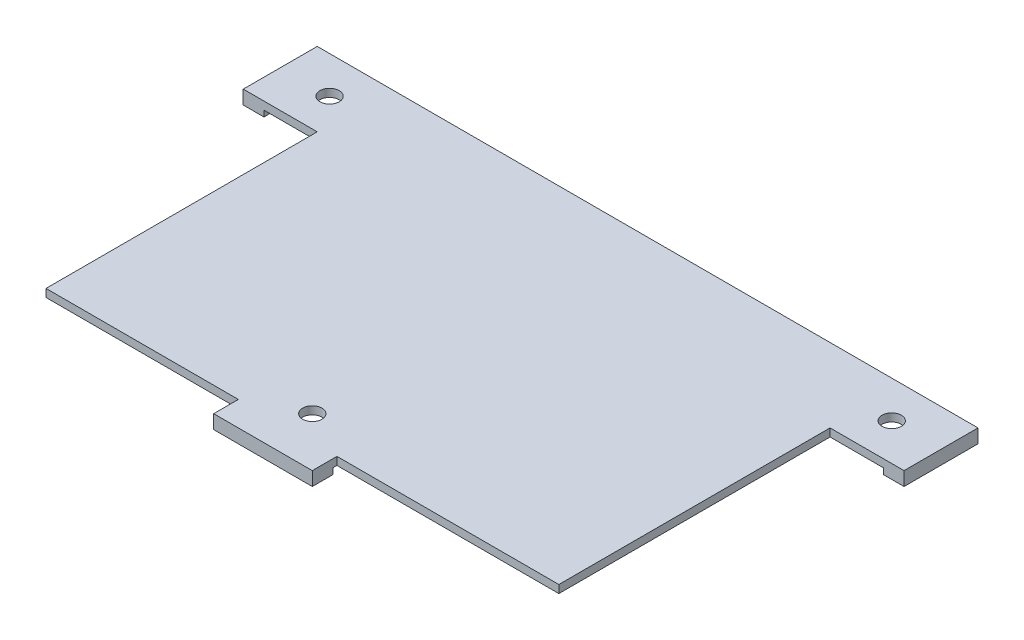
ISO-10303-21;
HEADER;
FILE_DESCRIPTION(('STEP AP214'),'2;1');
FILE_NAME('part.step','',(''),(''),'','','');
FILE_SCHEMA(('AUTOMOTIVE_DESIGN { 1 0 10303 214 1 1 1 1 }'));
ENDSEC;
DATA;
#1=APPLICATION_CONTEXT('core data for automotive mechanical design processes');
#2=APPLICATION_PROTOCOL_DEFINITION('international standard','automotive_design',2000,#1);
#3=PRODUCT_CONTEXT('',#1,'mechanical');
#4=PRODUCT('Part','Part','',(#3));
#5=PRODUCT_RELATED_PRODUCT_CATEGORY('part','',(#4));
#6=PRODUCT_DEFINITION_FORMATION('','',#4);
#7=PRODUCT_DEFINITION_CONTEXT('part definition',#1,'design');
#8=PRODUCT_DEFINITION('design','',#6,#7);
#9=PRODUCT_DEFINITION_SHAPE('','',#8);
#10=(LENGTH_UNIT() NAMED_UNIT(*) SI_UNIT(.MILLI.,.METRE.));
#11=(NAMED_UNIT(*) PLANE_ANGLE_UNIT() SI_UNIT($,.RADIAN.));
#12=(NAMED_UNIT(*) SI_UNIT($,.STERADIAN.) SOLID_ANGLE_UNIT());
#13=UNCERTAINTY_MEASURE_WITH_UNIT(LENGTH_MEASURE(1.E-05),#10,'distance_accuracy_value','');
#14=(GEOMETRIC_REPRESENTATION_CONTEXT(3) GLOBAL_UNCERTAINTY_ASSIGNED_CONTEXT((#13)) GLOBAL_UNIT_ASSIGNED_CONTEXT((#10,
#11,#12)) REPRESENTATION_CONTEXT('',''));
#15=CARTESIAN_POINT('',(0.,0.,0.));
#16=DIRECTION('',(0.,0.,1.));
#17=DIRECTION('',(1.,0.,0.));
#18=AXIS2_PLACEMENT_3D('',#15,#16,#17);
#19=CARTESIAN_POINT('',(0.,0.,0.));
#20=DIRECTION('',(0.,1.,0.));
#21=DIRECTION('',(0.,0.,1.));
#22=AXIS2_PLACEMENT_3D('',#19,#20,#21);
#23=PLANE('',#22);
#24=CARTESIAN_POINT('',(-10.070703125,0.,-17.9294117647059));
#25=CARTESIAN_POINT('',(-10.0993932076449,0.,-17.9264224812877));
#26=CARTESIAN_POINT('',(-10.1568725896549,0.,-17.9204335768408));
#27=CARTESIAN_POINT('',(-10.2383448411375,0.,-17.8754187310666));
#28=CARTESIAN_POINT('',(-10.3048100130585,0.,-17.7978871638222));
#29=CARTESIAN_POINT('',(-10.3657076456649,0.,-17.6908588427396));
#30=CARTESIAN_POINT('',(-10.4089982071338,0.,-17.5466016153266));
#31=CARTESIAN_POINT('',(-10.4406407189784,0.,-17.3645480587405));
#32=CARTESIAN_POINT('',(-10.4559533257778,0.,-17.1407719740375));
#33=CARTESIAN_POINT('',(-10.4578087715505,0.,-16.977118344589));
#34=CARTESIAN_POINT('',(-10.4588235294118,0.,-16.8876148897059));
#35=B_SPLINE_CURVE_WITH_KNOTS('',3,(#24,#25,#26,#27,#28,#29,#30,#31,#32,#33,#34),.UNSPECIFIED.,
.F.,.F.,(4,1,1,1,1,1,1,1,4),(0.,0.0709058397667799,0.142056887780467,0.223908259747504,
0.321037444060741,0.445236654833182,0.594585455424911,0.778275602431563,1.),.UNSPECIFIED.);
#36=CARTESIAN_POINT('',(-10.070703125,0.,-17.9294117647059));
#37=VERTEX_POINT('',#36);
#38=CARTESIAN_POINT('',(-10.4588235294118,0.,-16.8876148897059));
#39=VERTEX_POINT('',#38);
#40=EDGE_CURVE('E64',#37,#39,#35,.T.);
#41=ORIENTED_EDGE('',*,*,#40,.T.);
#42=CARTESIAN_POINT('',(-10.4588235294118,0.,-16.8876148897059));
#43=CARTESIAN_POINT('',(-10.4569430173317,0.,-16.8000164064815));
#44=CARTESIAN_POINT('',(-10.4534894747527,0.,-16.6391426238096));
#45=CARTESIAN_POINT('',(-10.4342912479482,0.,-16.4185234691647));
#46=CARTESIAN_POINT('',(-10.4025530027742,0.,-16.2392249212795));
#47=CARTESIAN_POINT('',(-10.3522273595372,0.,-16.1008993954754));
#48=CARTESIAN_POINT('',(-10.2942923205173,0.,-15.9982887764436));
#49=CARTESIAN_POINT('',(-10.2274031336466,0.,-15.9255001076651));
#50=CARTESIAN_POINT('',(-10.1484407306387,0.,-15.8802952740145));
#51=CARTESIAN_POINT('',(-10.0906957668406,0.,-15.8767599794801));
#52=CARTESIAN_POINT('',(-10.0619485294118,0.,-15.875));
#53=B_SPLINE_CURVE_WITH_KNOTS('',3,(#42,#43,#44,#45,#46,#47,#48,#49,#50,#51,#52),.UNSPECIFIED.,
.F.,.F.,(4,1,1,1,1,1,1,1,4),(0.,0.221435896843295,0.406664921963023,0.559540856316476,
0.680133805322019,0.777133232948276,0.855398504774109,0.928012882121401,1.),.UNSPECIFIED.);
#54=CARTESIAN_POINT('',(-10.0619485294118,0.,-15.875));
#55=VERTEX_POINT('',#54);
#56=EDGE_CURVE('E947',#39,#55,#53,.T.);
#57=ORIENTED_EDGE('',*,*,#56,.T.);
#58=DIRECTION('',(1.,0.,0.));
#59=VECTOR('',#58,1.);
#60=CARTESIAN_POINT('',(-10.0619485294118,0.,-15.875));
#61=LINE('',#60,#59);
#62=CARTESIAN_POINT('',(-2.99990808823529,0.,-15.875));
#63=VERTEX_POINT('',#62);
#64=EDGE_CURVE('E966',#55,#63,#61,.T.);
#65=ORIENTED_EDGE('',*,*,#64,.T.);
#66=CARTESIAN_POINT('',(-2.99990808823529,0.,-15.875));
#67=CARTESIAN_POINT('',(-2.97397874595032,0.,-15.8768316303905));
#68=CARTESIAN_POINT('',(-2.92066223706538,0.,-15.8805978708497));
#69=CARTESIAN_POINT('',(-2.84824910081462,0.,-15.9284566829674));
#70=CARTESIAN_POINT('',(-2.7787595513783,0.,-15.9967546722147));
#71=CARTESIAN_POINT('',(-2.72163183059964,0.,-16.101244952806));
#72=CARTESIAN_POINT('',(-2.67068216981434,0.,-16.2390792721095));
#73=CARTESIAN_POINT('',(-2.64022401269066,0.,-16.4187525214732));
#74=CARTESIAN_POINT('',(-2.61523647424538,0.,-16.6388624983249));
#75=CARTESIAN_POINT('',(-2.61489285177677,0.,-16.7999597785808));
#76=CARTESIAN_POINT('',(-2.61470588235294,0.,-16.8876148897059));
#77=B_SPLINE_CURVE_WITH_KNOTS('',3,(#66,#67,#68,#69,#70,#71,#72,#73,#74,#75,#76),.UNSPECIFIED.,
.F.,.F.,(4,1,1,1,1,1,1,1,4),(0.,0.0653203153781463,0.134313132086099,0.215080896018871,
0.313029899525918,0.434803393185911,0.589175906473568,0.776465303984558,1.),.UNSPECIFIED.);
#78=CARTESIAN_POINT('',(-2.61470588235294,0.,-16.8876148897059));
#79=VERTEX_POINT('',#78);
#80=EDGE_CURVE('E964',#63,#79,#77,.T.);
#81=ORIENTED_EDGE('',*,*,#80,.T.);
#82=CARTESIAN_POINT('',(-2.61470588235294,0.,-16.8876148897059));
#83=CARTESIAN_POINT('',(-2.61527928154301,0.,-16.9771561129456));
#84=CARTESIAN_POINT('',(-2.61632825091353,0.,-17.1409617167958));
#85=CARTESIAN_POINT('',(-2.63661109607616,0.,-17.3643962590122));
#86=CARTESIAN_POINT('',(-2.66728542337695,0.,-17.5466156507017));
#87=CARTESIAN_POINT('',(-2.71077090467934,0.,-17.6908561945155));
#88=CARTESIAN_POINT('',(-2.7716314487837,0.,-17.7978876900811));
#89=CARTESIAN_POINT('',(-2.83810406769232,0.,-17.8754186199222));
#90=CARTESIAN_POINT('',(-2.91957471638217,0.,-17.9204336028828));
#91=CARTESIAN_POINT('',(-2.97705430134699,0.,-17.9264224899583));
#92=CARTESIAN_POINT('',(-3.00574448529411,0.,-17.9294117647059));
#93=B_SPLINE_CURVE_WITH_KNOTS('',3,(#82,#83,#84,#85,#86,#87,#88,#89,#90,#91,#92),.UNSPECIFIED.,
.F.,.F.,(4,1,1,1,1,1,1,1,4),(0.,0.221678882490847,0.405536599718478,0.554854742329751,
0.679028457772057,0.776137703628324,0.857972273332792,0.929108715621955,1.),.UNSPECIFIED.);
#94=CARTESIAN_POINT('',(-3.00574448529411,0.,-17.9294117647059));
#95=VERTEX_POINT('',#94);
#96=EDGE_CURVE('E757',#79,#95,#93,.T.);
#97=ORIENTED_EDGE('',*,*,#96,.T.);
#98=DIRECTION('',(-1.,0.,0.));
#99=VECTOR('',#98,1.);
#100=CARTESIAN_POINT('',(-3.00574448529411,0.,-17.9294117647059));
#101=LINE('',#100,#99);
#102=CARTESIAN_POINT('',(-5.41617647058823,0.,-17.9294117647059));
#103=VERTEX_POINT('',#102);
#104=EDGE_CURVE('E754',#95,#103,#101,.T.);
#105=ORIENTED_EDGE('',*,*,#104,.T.);
#106=DIRECTION('',(0.,0.,-1.));
#107=VECTOR('',#106,1.);
#108=CARTESIAN_POINT('',(-5.41617647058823,0.,-17.9294117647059));
#109=LINE('',#108,#107);
#110=CARTESIAN_POINT('',(-5.41617647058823,0.,-25.9602941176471));
#111=VERTEX_POINT('',#110);
#112=EDGE_CURVE('E716',#103,#111,#109,.T.);
#113=ORIENTED_EDGE('',*,*,#112,.T.);
#114=DIRECTION('',(0.878465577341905,0.,0.477805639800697));
#115=VECTOR('',#114,1.);
#116=CARTESIAN_POINT('',(-5.41617647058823,0.,-25.9602941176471));
#117=LINE('',#116,#115);
#118=CARTESIAN_POINT('',(-3.35592830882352,0.,-24.8397058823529));
#119=VERTEX_POINT('',#118);
#120=EDGE_CURVE('E713',#111,#119,#117,.T.);
#121=ORIENTED_EDGE('',*,*,#120,.T.);
#122=CARTESIAN_POINT('',(-3.35592830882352,0.,-24.8397058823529));
#123=CARTESIAN_POINT('',(-3.28751952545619,0.,-24.8084990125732));
#124=CARTESIAN_POINT('',(-3.16765707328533,0.,-24.7538198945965));
#125=CARTESIAN_POINT('',(-3.00074231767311,0.,-24.706051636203));
#126=CARTESIAN_POINT('',(-2.85861767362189,0.,-24.6943394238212));
#127=CARTESIAN_POINT('',(-2.7447511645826,0.,-24.763988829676));
#128=CARTESIAN_POINT('',(-2.67349142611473,0.,-24.8947761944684));
#129=CARTESIAN_POINT('',(-2.6367734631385,0.,-25.0828990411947));
#130=CARTESIAN_POINT('',(-2.61521456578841,0.,-25.3410933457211));
#131=CARTESIAN_POINT('',(-2.61489123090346,0.,-25.5380573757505));
#132=CARTESIAN_POINT('',(-2.61470588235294,0.,-25.6509650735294));
#133=B_SPLINE_CURVE_WITH_KNOTS('',3,(#122,#123,#124,#125,#126,#127,#128,#129,#130,#131,#132),
.UNSPECIFIED.,.F.,.F.,(4,1,1,1,1,1,1,1,4),(0.,0.145301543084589,0.254590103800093,
0.337535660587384,0.411896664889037,0.498222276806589,0.618472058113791,0.781292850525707,1.),.UNSPECIFIED.);
#134=CARTESIAN_POINT('',(-2.61470588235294,0.,-25.6509650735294));
#135=VERTEX_POINT('',#134);
#136=EDGE_CURVE('E709',#119,#135,#133,.T.);
#137=ORIENTED_EDGE('',*,*,#136,.T.);
#138=CARTESIAN_POINT('',(-2.61470588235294,0.,-25.6509650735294));
#139=CARTESIAN_POINT('',(-2.61519561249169,0.,-25.723931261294));
#140=CARTESIAN_POINT('',(-2.61608410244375,0.,-25.8563097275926));
#141=CARTESIAN_POINT('',(-2.62379448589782,0.,-26.0365601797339));
#142=CARTESIAN_POINT('',(-2.6397461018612,0.,-26.1856509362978));
#143=CARTESIAN_POINT('',(-2.67075617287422,0.,-26.3090726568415));
#144=CARTESIAN_POINT('',(-2.71717995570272,0.,-26.4121724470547));
#145=CARTESIAN_POINT('',(-2.78379168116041,0.,-26.4951351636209));
#146=CARTESIAN_POINT('',(-2.86792327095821,0.,-26.5719878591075));
#147=CARTESIAN_POINT('',(-2.93405472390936,0.,-26.6177670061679));
#148=CARTESIAN_POINT('',(-2.97072610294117,0.,-26.6431525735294));
#149=B_SPLINE_CURVE_WITH_KNOTS('',3,(#138,#139,#140,#141,#142,#143,#144,#145,#146,#147,#148),
.UNSPECIFIED.,.F.,.F.,(4,1,1,1,1,1,1,1,4),(0.,0.195714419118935,0.355073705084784,
0.483884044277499,0.597170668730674,0.695219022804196,0.784470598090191,0.880484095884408,1.),.UNSPECIFIED.);
#150=CARTESIAN_POINT('',(-2.97072610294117,0.,-26.6431525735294));
#151=VERTEX_POINT('',#150);
#152=EDGE_CURVE('E712',#135,#151,#149,.T.);
#153=ORIENTED_EDGE('',*,*,#152,.T.);
#154=DIRECTION('',(-0.836531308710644,0.,-0.547919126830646));
#155=VECTOR('',#154,1.);
#156=CARTESIAN_POINT('',(-2.97072610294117,0.,-26.6431525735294));
#157=LINE('',#156,#155);
#158=CARTESIAN_POINT('',(-5.71966911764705,0.,-28.4436810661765));
#159=VERTEX_POINT('',#158);
#160=EDGE_CURVE('E945',#151,#159,#157,.T.);
#161=ORIENTED_EDGE('',*,*,#160,.T.);
#162=CARTESIAN_POINT('',(-5.71966911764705,0.,-28.4436810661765));
#163=CARTESIAN_POINT('',(-5.73766928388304,0.,-28.4571287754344));
#164=CARTESIAN_POINT('',(-5.77599825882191,0.,-28.4857638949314));
#165=CARTESIAN_POINT('',(-5.84908488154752,0.,-28.514624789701));
#166=CARTESIAN_POINT('',(-5.93927565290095,0.,-28.5322051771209));
#167=CARTESIAN_POINT('',(-6.04936780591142,0.,-28.5562013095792));
#168=CARTESIAN_POINT('',(-6.19142777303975,0.,-28.5640250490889));
#169=CARTESIAN_POINT('',(-6.37122898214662,0.,-28.5743891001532));
#170=CARTESIAN_POINT('',(-6.59904391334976,0.,-28.5752155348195));
#171=CARTESIAN_POINT('',(-6.76731331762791,0.,-28.5750769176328));
#172=CARTESIAN_POINT('',(-6.86068474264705,0.,-28.575));
#173=B_SPLINE_CURVE_WITH_KNOTS('',3,(#162,#163,#164,#165,#166,#167,#168,#169,#170,#171,#172),
.UNSPECIFIED.,.F.,.F.,(4,1,1,1,1,1,1,1,4),(0.,0.057737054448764,0.122943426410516,
0.200202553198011,0.294642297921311,0.412941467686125,0.566110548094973,0.759238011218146,1.),.UNSPECIFIED.);
#174=CARTESIAN_POINT('',(-6.86068474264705,0.,-28.575));
#175=VERTEX_POINT('',#174);
#176=EDGE_CURVE('E1003',#159,#175,#173,.T.);
#177=ORIENTED_EDGE('',*,*,#176,.T.);
#178=CARTESIAN_POINT('',(-6.86068474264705,0.,-28.575));
#179=CARTESIAN_POINT('',(-6.9754511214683,0.,-28.5746985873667));
#180=CARTESIAN_POINT('',(-7.18074934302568,0.,-28.5741594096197));
#181=CARTESIAN_POINT('',(-7.45467244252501,0.,-28.5648482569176));
#182=CARTESIAN_POINT('',(-7.66356728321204,0.,-28.5426594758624));
#183=CARTESIAN_POINT('',(-7.81864625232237,0.,-28.5227733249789));
#184=CARTESIAN_POINT('',(-7.92582619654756,0.,-28.4815738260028));
#185=CARTESIAN_POINT('',(-7.99704083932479,0.,-28.4266152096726));
#186=CARTESIAN_POINT('',(-8.0267548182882,0.,-28.3516829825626));
#187=CARTESIAN_POINT('',(-8.02947036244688,0.,-28.3008545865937));
#188=CARTESIAN_POINT('',(-8.03088235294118,0.,-28.2744255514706));
#189=B_SPLINE_CURVE_WITH_KNOTS('',3,(#178,#179,#180,#181,#182,#183,#184,#185,#186,#187,#188),
.UNSPECIFIED.,.F.,.F.,(4,1,1,1,1,1,1,1,4),(0.,0.261715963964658,0.468166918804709,
0.624190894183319,0.741233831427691,0.822783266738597,0.884126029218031,0.939749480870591,1.),.UNSPECIFIED.);
#190=CARTESIAN_POINT('',(-8.03088235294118,0.,-28.2744255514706));
#191=VERTEX_POINT('',#190);
#192=EDGE_CURVE('E962',#175,#191,#189,.T.);
#193=ORIENTED_EDGE('',*,*,#192,.T.);
#194=DIRECTION('',(0.,0.,1.));
#195=VECTOR('',#194,1.);
#196=CARTESIAN_POINT('',(-8.03088235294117,0.,-28.2744255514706));
#197=LINE('',#196,#195);
#198=CARTESIAN_POINT('',(-8.03088235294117,0.,-17.9294117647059));
#199=VERTEX_POINT('',#198);
#200=EDGE_CURVE('E960',#191,#199,#197,.T.);
#201=ORIENTED_EDGE('',*,*,#200,.T.);
#202=DIRECTION('',(-1.,0.,0.));
#203=VECTOR('',#202,1.);
#204=CARTESIAN_POINT('',(-8.03088235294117,0.,-17.9294117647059));
#205=LINE('',#204,#203);
#206=EDGE_CURVE('E369',#199,#37,#205,.T.);
#207=ORIENTED_EDGE('',*,*,#206,.T.);
#208=EDGE_LOOP('',(#41,#57,#65,#81,#97,#105,#113,#121,#137,#153,#161,#177,#193,#201,#207));
#209=FACE_BOUND('',#208,.T.);
#210=DIRECTION('',(0.,0.,-1.));
#211=VECTOR('',#210,1.);
#212=CARTESIAN_POINT('',(-31.115,0.,0.));
#213=LINE('',#212,#211);
#214=CARTESIAN_POINT('',(-31.115,0.,3.175));
#215=VERTEX_POINT('',#214);
#216=CARTESIAN_POINT('',(-31.115,0.,-31.75));
#217=VERTEX_POINT('',#216);
#218=EDGE_CURVE('E515',#215,#217,#213,.T.);
#219=ORIENTED_EDGE('',*,*,#218,.T.);
#220=DIRECTION('',(-1.,0.,0.));
#221=VECTOR('',#220,1.);
#222=CARTESIAN_POINT('',(-37.465,0.,-31.75));
#223=LINE('',#222,#221);
#224=CARTESIAN_POINT('',(-37.973,0.,-31.75));
#225=VERTEX_POINT('',#224);
#226=EDGE_CURVE('E497',#217,#225,#223,.T.);
#227=ORIENTED_EDGE('',*,*,#226,.T.);
#228=DIRECTION('',(0.,0.,-1.));
#229=VECTOR('',#228,1.);
#230=CARTESIAN_POINT('',(-37.973,0.,-41.275));
#231=LINE('',#230,#229);
#232=CARTESIAN_POINT('',(-37.973,0.,-41.275));
#233=VERTEX_POINT('',#232);
#234=EDGE_CURVE('E503',#225,#233,#231,.T.);
#235=ORIENTED_EDGE('',*,*,#234,.T.);
#236=DIRECTION('',(-1.,0.,0.));
#237=VECTOR('',#236,1.);
#238=CARTESIAN_POINT('',(-37.465,0.,-41.275));
#239=LINE('',#238,#237);
#240=CARTESIAN_POINT('',(41.783,0.,-41.275));
#241=VERTEX_POINT('',#240);
#242=EDGE_CURVE('E473',#241,#233,#239,.T.);
#243=ORIENTED_EDGE('',*,*,#242,.F.);
#244=DIRECTION('',(0.,0.,1.));
#245=VECTOR('',#244,1.);
#246=CARTESIAN_POINT('',(41.783,0.,-41.275));
#247=LINE('',#246,#245);
#248=CARTESIAN_POINT('',(41.783,0.,-31.75));
#249=VERTEX_POINT('',#248);
#250=EDGE_CURVE('E480',#241,#249,#247,.T.);
#251=ORIENTED_EDGE('',*,*,#250,.T.);
#252=DIRECTION('',(-1.,0.,0.));
#253=VECTOR('',#252,1.);
#254=CARTESIAN_POINT('',(41.275,0.,-31.75));
#255=LINE('',#254,#253);
#256=CARTESIAN_POINT('',(34.925,0.,-31.75));
#257=VERTEX_POINT('',#256);
#258=EDGE_CURVE('E545',#249,#257,#255,.T.);
#259=ORIENTED_EDGE('',*,*,#258,.T.);
#260=DIRECTION('',(0.,0.,1.));
#261=VECTOR('',#260,1.);
#262=CARTESIAN_POINT('',(34.925,0.,0.));
#263=LINE('',#262,#261);
#264=CARTESIAN_POINT('',(34.925,0.,3.175));
#265=VERTEX_POINT('',#264);
#266=EDGE_CURVE('E12',#257,#265,#263,.T.);
#267=ORIENTED_EDGE('',*,*,#266,.T.);
#268=DIRECTION('',(1.,0.,0.));
#269=VECTOR('',#268,1.);
#270=CARTESIAN_POINT('',(-37.465,0.,3.175));
#271=LINE('',#270,#269);
#272=CARTESIAN_POINT('',(6.35,0.,3.175));
#273=VERTEX_POINT('',#272);
#274=EDGE_CURVE('E639',#273,#265,#271,.T.);
#275=ORIENTED_EDGE('',*,*,#274,.F.);
#276=DIRECTION('',(0.,0.,1.));
#277=VECTOR('',#276,1.);
#278=CARTESIAN_POINT('',(6.35,0.,3.175));
#279=LINE('',#278,#277);
#280=CARTESIAN_POINT('',(6.35,0.,3.683));
#281=VERTEX_POINT('',#280);
#282=EDGE_CURVE('E520',#273,#281,#279,.T.);
#283=ORIENTED_EDGE('',*,*,#282,.T.);
#284=DIRECTION('',(-1.,0.,0.));
#285=VECTOR('',#284,1.);
#286=CARTESIAN_POINT('',(6.35,0.,3.683));
#287=LINE('',#286,#285);
#288=CARTESIAN_POINT('',(-6.35,0.,3.683));
#289=VERTEX_POINT('',#288);
#290=EDGE_CURVE('E514',#281,#289,#287,.T.);
#291=ORIENTED_EDGE('',*,*,#290,.T.);
#292=DIRECTION('',(0.,0.,-1.));
#293=VECTOR('',#292,1.);
#294=CARTESIAN_POINT('',(-6.35,0.,3.175));
#295=LINE('',#294,#293);
#296=CARTESIAN_POINT('',(-6.35,0.,3.175));
#297=VERTEX_POINT('',#296);
#298=EDGE_CURVE('E524',#289,#297,#295,.T.);
#299=ORIENTED_EDGE('',*,*,#298,.T.);
#300=EDGE_CURVE('E649',#215,#297,#271,.T.);
#301=ORIENTED_EDGE('',*,*,#300,.F.);
#302=EDGE_LOOP('',(#219,#227,#235,#243,#251,#259,#267,#275,#283,#291,#299,#301));
#303=FACE_BOUND('',#302,.T.);
#304=CARTESIAN_POINT('',(-34.29,0.,-36.5125));
#305=DIRECTION('',(0.,1.,0.));
#306=DIRECTION('',(0.,0.,1.));
#307=AXIS2_PLACEMENT_3D('',#304,#305,#306);
#308=CIRCLE('',#307,1.2446);
#309=CARTESIAN_POINT('',(-34.29,0.,-35.2679));
#310=VERTEX_POINT('',#309);
#311=EDGE_CURVE('E631',#310,#310,#308,.T.);
#312=ORIENTED_EDGE('',*,*,#311,.T.);
#313=EDGE_LOOP('',(#312));
#314=FACE_BOUND('',#313,.T.);
#315=CARTESIAN_POINT('',(0.,0.,0.));
#316=DIRECTION('',(0.,1.,0.));
#317=DIRECTION('',(0.,0.,1.));
#318=AXIS2_PLACEMENT_3D('',#315,#316,#317);
#319=CIRCLE('',#318,1.2446);
#320=CARTESIAN_POINT('',(0.,0.,1.2446));
#321=VERTEX_POINT('',#320);
#322=EDGE_CURVE('E623',#321,#321,#319,.T.);
#323=ORIENTED_EDGE('',*,*,#322,.T.);
#324=EDGE_LOOP('',(#323));
#325=FACE_BOUND('',#324,.T.);
#326=CARTESIAN_POINT('',(38.1,0.,-36.5125));
#327=DIRECTION('',(0.,1.,0.));
#328=DIRECTION('',(0.,0.,1.));
#329=AXIS2_PLACEMENT_3D('',#326,#327,#328);
#330=CIRCLE('',#329,1.2446);
#331=CARTESIAN_POINT('',(38.1,0.,-35.2679));
#332=VERTEX_POINT('',#331);
#333=EDGE_CURVE('E618',#332,#332,#330,.T.);
#334=ORIENTED_EDGE('',*,*,#333,.T.);
#335=EDGE_LOOP('',(#334));
#336=FACE_BOUND('',#335,.T.);
#337=DIRECTION('',(0.321272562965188,0.,0.946986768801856));
#338=VECTOR('',#337,1.);
#339=CARTESIAN_POINT('',(-0.653676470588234,0.,-27.5448759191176));
#340=LINE('',#339,#338);
#341=CARTESIAN_POINT('',(-0.653676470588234,0.,-27.5448759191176));
#342=VERTEX_POINT('',#341);
#343=CARTESIAN_POINT('',(3.13414522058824,0.,-16.3798483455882));
#344=VERTEX_POINT('',#343);
#345=EDGE_CURVE('E56',#342,#344,#340,.T.);
#346=ORIENTED_EDGE('',*,*,#345,.T.);
#347=CARTESIAN_POINT('',(3.13414522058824,0.,-16.3798483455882));
#348=CARTESIAN_POINT('',(3.15214534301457,0.,-16.3297160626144));
#349=CARTESIAN_POINT('',(3.18547298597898,0.,-16.23689498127));
#350=CARTESIAN_POINT('',(3.25637645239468,0.,-16.1084945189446));
#351=CARTESIAN_POINT('',(3.37095740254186,0.,-16.0115966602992));
#352=CARTESIAN_POINT('',(3.53445342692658,0.,-15.9502352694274));
#353=CARTESIAN_POINT('',(3.74839925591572,0.,-15.9040893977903));
#354=CARTESIAN_POINT('',(3.96754562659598,0.,-15.8899468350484));
#355=CARTESIAN_POINT('',(4.17786609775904,0.,-15.883668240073));
#356=CARTESIAN_POINT('',(4.36655780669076,0.,-15.8769770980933));
#357=CARTESIAN_POINT('',(4.57864569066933,0.,-15.8744095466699));
#358=CARTESIAN_POINT('',(4.72748125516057,0.,-15.874795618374));
#359=CARTESIAN_POINT('',(4.80627297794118,0.,-15.875));
#360=B_SPLINE_CURVE_WITH_KNOTS('',3,(#347,#348,#349,#350,#351,#352,#353,#354,#355,#356,#357,
#358,#359),.UNSPECIFIED.,.F.,.F.,(4,1,1,1,1,1,1,1,1,1,4),(0.,0.0844651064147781,
0.156389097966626,0.229639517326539,0.316696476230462,0.430418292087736,0.575876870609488,
0.663816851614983,0.764085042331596,0.875109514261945,1.),.UNSPECIFIED.);
#361=CARTESIAN_POINT('',(4.80627297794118,0.,-15.875));
#362=VERTEX_POINT('',#361);
#363=EDGE_CURVE('E346',#344,#362,#360,.T.);
#364=ORIENTED_EDGE('',*,*,#363,.T.);
#365=CARTESIAN_POINT('',(4.80627297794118,0.,-15.875));
#366=CARTESIAN_POINT('',(4.92885175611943,0.,-15.8742125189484));
#367=CARTESIAN_POINT('',(5.15554339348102,0.,-15.8727561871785));
#368=CARTESIAN_POINT('',(5.46960752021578,0.,-15.8819385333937));
#369=CARTESIAN_POINT('',(5.7337333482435,0.,-15.8822509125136));
#370=CARTESIAN_POINT('',(5.95340129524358,0.,-15.9027547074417));
#371=CARTESIAN_POINT('',(6.13395938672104,0.,-15.9212877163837));
#372=CARTESIAN_POINT('',(6.28008631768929,0.,-15.9585966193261));
#373=CARTESIAN_POINT('',(6.39859776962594,0.,-16.0009470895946));
#374=CARTESIAN_POINT('',(6.49507721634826,0.,-16.0550236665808));
#375=CARTESIAN_POINT('',(6.57510116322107,0.,-16.1180655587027));
#376=CARTESIAN_POINT('',(6.62740055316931,0.,-16.2036194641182));
#377=CARTESIAN_POINT('',(6.67220030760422,0.,-16.2999233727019));
#378=CARTESIAN_POINT('',(6.69606093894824,0.,-16.3707860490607));
#379=CARTESIAN_POINT('',(6.70893841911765,0.,-16.4090303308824));
#380=B_SPLINE_CURVE_WITH_KNOTS('',3,(#365,#366,#367,#368,#369,#370,#371,#372,#373,#374,#375,
#376,#377,#378,#379),.UNSPECIFIED.,.F.,.F.,(4,1,1,1,1,1,1,1,1,1,1,1,4),(0.,0.172131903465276,
0.318332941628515,0.441314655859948,0.542739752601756,0.62814176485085,0.695733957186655,
0.754094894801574,0.804252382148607,0.850780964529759,0.895111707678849,0.943392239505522,1.),.UNSPECIFIED.);
#381=CARTESIAN_POINT('',(6.70893841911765,0.,-16.4090303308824));
#382=VERTEX_POINT('',#381);
#383=EDGE_CURVE('E724',#362,#382,#380,.T.);
#384=ORIENTED_EDGE('',*,*,#383,.T.);
#385=DIRECTION('',(0.325784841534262,0.,-0.94544393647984));
#386=VECTOR('',#385,1.);
#387=CARTESIAN_POINT('',(6.70893841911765,0.,-16.4090303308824));
#388=LINE('',#387,#386);
#389=CARTESIAN_POINT('',(10.5522058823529,0.,-27.5623851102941));
#390=VERTEX_POINT('',#389);
#391=EDGE_CURVE('E727',#382,#390,#388,.T.);
#392=ORIENTED_EDGE('',*,*,#391,.T.);
#393=CARTESIAN_POINT('',(10.5522058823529,0.,-27.5623851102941));
#394=CARTESIAN_POINT('',(10.5696613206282,0.,-27.6178358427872));
#395=CARTESIAN_POINT('',(10.6023607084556,0.,-27.7217120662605));
#396=CARTESIAN_POINT('',(10.6493204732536,0.,-27.868277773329));
#397=CARTESIAN_POINT('',(10.6769889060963,0.,-27.9985202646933));
#398=CARTESIAN_POINT('',(10.6968292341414,0.,-28.111278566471));
#399=CARTESIAN_POINT('',(10.7013720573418,0.,-28.2087115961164));
#400=CARTESIAN_POINT('',(10.6881409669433,0.,-28.2946667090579));
#401=CARTESIAN_POINT('',(10.651259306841,0.,-28.3669192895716));
#402=CARTESIAN_POINT('',(10.5964729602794,0.,-28.4280311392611));
#403=CARTESIAN_POINT('',(10.5204324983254,0.,-28.4750482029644));
#404=CARTESIAN_POINT('',(10.4234503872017,0.,-28.5083458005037));
#405=CARTESIAN_POINT('',(10.307599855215,0.,-28.538157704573));
#406=CARTESIAN_POINT('',(10.1673937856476,0.,-28.5542874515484));
#407=CARTESIAN_POINT('',(10.0026157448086,0.,-28.5601906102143));
#408=CARTESIAN_POINT('',(9.80916303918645,0.,-28.5715047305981));
#409=CARTESIAN_POINT('',(9.58626511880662,0.,-28.5716060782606));
#410=CARTESIAN_POINT('',(9.42772039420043,0.,-28.5738278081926));
#411=CARTESIAN_POINT('',(9.34407169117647,0.,-28.575));
#412=B_SPLINE_CURVE_WITH_KNOTS('',3,(#393,#394,#395,#396,#397,#398,#399,#400,#401,#402,#403,
#404,#405,#406,#407,#408,#409,#410,#411),.UNSPECIFIED.,.F.,.F.,(4,1,1,1,1,1,1,1,1,1,1,1,1,1,1,1,
4),(0.,0.079766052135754,0.149426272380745,0.21094127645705,0.262278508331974,0.306335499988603,
0.344291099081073,0.380098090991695,0.416004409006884,0.455613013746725,0.501219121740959,
0.556239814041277,0.619467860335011,0.694304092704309,0.782468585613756,0.885229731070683,1.),.UNSPECIFIED.);
#413=CARTESIAN_POINT('',(9.34407169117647,0.,-28.575));
#414=VERTEX_POINT('',#413);
#415=EDGE_CURVE('E752',#390,#414,#412,.T.);
#416=ORIENTED_EDGE('',*,*,#415,.T.);
#417=CARTESIAN_POINT('',(9.34407169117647,0.,-28.575));
#418=CARTESIAN_POINT('',(9.27207641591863,0.,-28.5757637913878));
#419=CARTESIAN_POINT('',(9.13681211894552,0.,-28.5771987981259));
#420=CARTESIAN_POINT('',(8.94627825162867,0.,-28.5678174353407));
#421=CARTESIAN_POINT('',(8.77975823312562,0.,-28.5681718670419));
#422=CARTESIAN_POINT('',(8.60030021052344,0.,-28.5568370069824));
#423=CARTESIAN_POINT('',(8.41936158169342,0.,-28.5338272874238));
#424=CARTESIAN_POINT('',(8.24405269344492,0.,-28.4982125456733));
#425=CARTESIAN_POINT('',(8.11525503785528,0.,-28.4366516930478));
#426=CARTESIAN_POINT('',(8.03317115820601,0.,-28.3426765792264));
#427=CARTESIAN_POINT('',(7.98282339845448,0.,-28.2268429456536));
#428=CARTESIAN_POINT('',(7.95346446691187,0.,-28.1442468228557));
#429=CARTESIAN_POINT('',(7.9375,0.,-28.0993336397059));
#430=B_SPLINE_CURVE_WITH_KNOTS('',3,(#417,#418,#419,#420,#421,#422,#423,#424,#425,#426,#427,
#428,#429),.UNSPECIFIED.,.F.,.F.,(4,1,1,1,1,1,1,1,1,1,4),(0.,0.132676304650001,
0.249271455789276,0.351483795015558,0.439501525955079,0.580494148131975,0.68747021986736,
0.76846987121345,0.838301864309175,0.912073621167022,1.),.UNSPECIFIED.);
#431=CARTESIAN_POINT('',(7.9375,0.,-28.0993336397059));
#432=VERTEX_POINT('',#431);
#433=EDGE_CURVE('E749',#414,#432,#430,.T.);
#434=ORIENTED_EDGE('',*,*,#433,.T.);
#435=DIRECTION('',(-0.310132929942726,0.,0.950693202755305));
#436=VECTOR('',#435,1.);
#437=CARTESIAN_POINT('',(7.9375,0.,-28.0993336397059));
#438=LINE('',#437,#436);
#439=CARTESIAN_POINT('',(4.77125459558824,0.,-18.3934053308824));
#440=VERTEX_POINT('',#439);
#441=EDGE_CURVE('E747',#432,#440,#438,.T.);
#442=ORIENTED_EDGE('',*,*,#441,.T.);
#443=DIRECTION('',(-1.,0.,0.));
#444=VECTOR('',#443,1.);
#445=CARTESIAN_POINT('',(4.77125459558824,0.,-18.3934053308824));
#446=LINE('',#445,#444);
#447=CARTESIAN_POINT('',(4.7625,0.,-18.3934053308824));
#448=VERTEX_POINT('',#447);
#449=EDGE_CURVE('E743',#440,#448,#446,.T.);
#450=ORIENTED_EDGE('',*,*,#449,.T.);
#451=DIRECTION('',(-0.295627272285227,0.,-0.955303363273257));
#452=VECTOR('',#451,1.);
#453=CARTESIAN_POINT('',(4.7625,0.,-18.3934053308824));
#454=LINE('',#453,#452);
#455=CARTESIAN_POINT('',(1.77426470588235,0.,-28.0497242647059));
#456=VERTEX_POINT('',#455);
#457=EDGE_CURVE('E746',#448,#456,#454,.T.);
#458=ORIENTED_EDGE('',*,*,#457,.T.);
#459=CARTESIAN_POINT('',(1.77426470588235,0.,-28.0497242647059));
#460=CARTESIAN_POINT('',(1.75973544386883,0.,-28.0996248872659));
#461=CARTESIAN_POINT('',(1.73292284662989,0.,-28.1917125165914));
#462=CARTESIAN_POINT('',(1.67996208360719,0.,-28.3179634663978));
#463=CARTESIAN_POINT('',(1.59257323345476,0.,-28.4206525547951));
#464=CARTESIAN_POINT('',(1.45752134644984,0.,-28.4887770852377));
#465=CARTESIAN_POINT('',(1.27443938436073,0.,-28.537639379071));
#466=CARTESIAN_POINT('',(1.0850146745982,0.,-28.5559068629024));
#467=CARTESIAN_POINT('',(0.898970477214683,0.,-28.5684125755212));
#468=CARTESIAN_POINT('',(0.726566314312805,0.,-28.5677566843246));
#469=CARTESIAN_POINT('',(0.529234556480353,0.,-28.5771793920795));
#470=CARTESIAN_POINT('',(0.389106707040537,0.,-28.5757527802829));
#471=CARTESIAN_POINT('',(0.315165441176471,0.,-28.575));
#472=B_SPLINE_CURVE_WITH_KNOTS('',3,(#459,#460,#461,#462,#463,#464,#465,#466,#467,#468,#469,
#470,#471),.UNSPECIFIED.,.F.,.F.,(4,1,1,1,1,1,1,1,1,1,4),(0.,0.0910437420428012,
0.168013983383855,0.238036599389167,0.321915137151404,0.428137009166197,0.568843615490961,
0.654162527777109,0.754672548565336,0.870548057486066,1.),.UNSPECIFIED.);
#473=CARTESIAN_POINT('',(0.315165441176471,0.,-28.575));
#474=VERTEX_POINT('',#473);
#475=EDGE_CURVE('E785',#456,#474,#472,.T.);
#476=ORIENTED_EDGE('',*,*,#475,.T.);
#477=CARTESIAN_POINT('',(0.315165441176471,0.,-28.575));
#478=CARTESIAN_POINT('',(0.243180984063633,0.,-28.5742584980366));
#479=CARTESIAN_POINT('',(0.106970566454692,0.,-28.5728554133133));
#480=CARTESIAN_POINT('',(-0.0847253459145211,0.,-28.5673842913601));
#481=CARTESIAN_POINT('',(-0.251058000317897,0.,-28.5583241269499));
#482=CARTESIAN_POINT('',(-0.392731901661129,0.,-28.5489038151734));
#483=CARTESIAN_POINT('',(-0.511132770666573,0.,-28.5286916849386));
#484=CARTESIAN_POINT('',(-0.610095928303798,0.,-28.5003577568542));
#485=CARTESIAN_POINT('',(-0.68950506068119,0.,-28.4610026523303));
#486=CARTESIAN_POINT('',(-0.769480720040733,0.,-28.3914831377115));
#487=CARTESIAN_POINT('',(-0.822435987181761,0.,-28.2593950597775));
#488=CARTESIAN_POINT('',(-0.812387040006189,0.,-28.0647109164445));
#489=CARTESIAN_POINT('',(-0.74911238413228,0.,-27.8237485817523));
#490=CARTESIAN_POINT('',(-0.688138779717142,0.,-27.6455780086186));
#491=CARTESIAN_POINT('',(-0.653676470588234,0.,-27.5448759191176));
#492=B_SPLINE_CURVE_WITH_KNOTS('',3,(#477,#478,#479,#480,#481,#482,#483,#484,#485,#486,#487,
#488,#489,#490,#491),.UNSPECIFIED.,.F.,.F.,(4,1,1,1,1,1,1,1,1,1,1,1,4),(0.,0.108300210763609,
0.204927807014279,0.288456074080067,0.358941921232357,0.418366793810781,0.468826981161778,
0.51333402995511,0.550643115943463,0.62597535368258,0.716705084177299,0.83988158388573,1.),.UNSPECIFIED.);
#493=EDGE_CURVE('E342',#474,#342,#492,.T.);
#494=ORIENTED_EDGE('',*,*,#493,.T.);
#495=EDGE_LOOP('',(#346,#364,#384,#392,#416,#434,#442,#450,#458,#476,#494));
#496=FACE_BOUND('',#495,.T.);
#497=ADVANCED_FACE('F40',(#209,#303,#314,#325,#336,#496),#23,.F.);
#498=CARTESIAN_POINT('',(-37.465,1.016,3.175));
#499=DIRECTION('',(0.,0.,-1.));
#500=DIRECTION('',(-1.,0.,0.));
#501=AXIS2_PLACEMENT_3D('',#498,#499,#500);
#502=PLANE('',#501);
#503=ORIENTED_EDGE('',*,*,#274,.T.);
#504=DIRECTION('',(0.,1.,0.));
#505=VECTOR('',#504,1.);
#506=CARTESIAN_POINT('',(34.925,-0.762000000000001,3.175));
#507=LINE('',#506,#505);
#508=CARTESIAN_POINT('',(34.925,1.016,3.175));
#509=VERTEX_POINT('',#508);
#510=EDGE_CURVE('E676',#265,#509,#507,.T.);
#511=ORIENTED_EDGE('',*,*,#510,.T.);
#512=DIRECTION('',(1.,0.,0.));
#513=VECTOR('',#512,1.);
#514=CARTESIAN_POINT('',(-37.465,1.016,3.175));
#515=LINE('',#514,#513);
#516=CARTESIAN_POINT('',(6.35,1.016,3.175));
#517=VERTEX_POINT('',#516);
#518=EDGE_CURVE('E646',#517,#509,#515,.T.);
#519=ORIENTED_EDGE('',*,*,#518,.F.);
#520=DIRECTION('',(0.,1.,0.));
#521=VECTOR('',#520,1.);
#522=CARTESIAN_POINT('',(6.35,-14.6148603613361,3.175));
#523=LINE('',#522,#521);
#524=EDGE_CURVE('E583',#273,#517,#523,.T.);
#525=ORIENTED_EDGE('',*,*,#524,.F.);
#526=EDGE_LOOP('',(#503,#511,#519,#525));
#527=FACE_BOUND('',#526,.T.);
#528=ADVANCED_FACE('F460',(#527),#502,.F.);
#529=CARTESIAN_POINT('',(0.,1.016,0.));
#530=DIRECTION('',(0.,1.,0.));
#531=DIRECTION('',(0.,0.,1.));
#532=AXIS2_PLACEMENT_3D('',#529,#530,#531);
#533=PLANE('',#532);
#534=DIRECTION('',(1.,0.,0.));
#535=VECTOR('',#534,1.);
#536=CARTESIAN_POINT('',(-37.465,1.016,-31.75));
#537=LINE('',#536,#535);
#538=CARTESIAN_POINT('',(-40.64,1.016,-31.75));
#539=VERTEX_POINT('',#538);
#540=CARTESIAN_POINT('',(-31.115,1.016,-31.75));
#541=VERTEX_POINT('',#540);
#542=EDGE_CURVE('E606',#539,#541,#537,.T.);
#543=ORIENTED_EDGE('',*,*,#542,.T.);
#544=DIRECTION('',(0.,0.,-1.));
#545=VECTOR('',#544,1.);
#546=CARTESIAN_POINT('',(-31.115,1.016,3.175));
#547=LINE('',#546,#545);
#548=CARTESIAN_POINT('',(-31.115,1.016,3.175));
#549=VERTEX_POINT('',#548);
#550=EDGE_CURVE('E670',#549,#541,#547,.T.);
#551=ORIENTED_EDGE('',*,*,#550,.F.);
#552=CARTESIAN_POINT('',(-6.35,1.016,3.175));
#553=VERTEX_POINT('',#552);
#554=EDGE_CURVE('E643',#549,#553,#515,.T.);
#555=ORIENTED_EDGE('',*,*,#554,.T.);
#556=DIRECTION('',(0.,0.,1.));
#557=VECTOR('',#556,1.);
#558=CARTESIAN_POINT('',(-6.35,1.016,3.175));
#559=LINE('',#558,#557);
#560=CARTESIAN_POINT('',(-6.35,1.016,6.35));
#561=VERTEX_POINT('',#560);
#562=EDGE_CURVE('E557',#553,#561,#559,.T.);
#563=ORIENTED_EDGE('',*,*,#562,.T.);
#564=DIRECTION('',(1.,0.,0.));
#565=VECTOR('',#564,1.);
#566=CARTESIAN_POINT('',(-6.35,1.016,6.35));
#567=LINE('',#566,#565);
#568=CARTESIAN_POINT('',(6.35,1.016,6.35));
#569=VERTEX_POINT('',#568);
#570=EDGE_CURVE('E570',#561,#569,#567,.T.);
#571=ORIENTED_EDGE('',*,*,#570,.T.);
#572=DIRECTION('',(0.,0.,-1.));
#573=VECTOR('',#572,1.);
#574=CARTESIAN_POINT('',(6.35,1.016,3.175));
#575=LINE('',#574,#573);
#576=EDGE_CURVE('E574',#569,#517,#575,.T.);
#577=ORIENTED_EDGE('',*,*,#576,.T.);
#578=ORIENTED_EDGE('',*,*,#518,.T.);
#579=DIRECTION('',(0.,0.,1.));
#580=VECTOR('',#579,1.);
#581=CARTESIAN_POINT('',(34.925,1.016,3.175));
#582=LINE('',#581,#580);
#583=CARTESIAN_POINT('',(34.925,1.016,-31.75));
#584=VERTEX_POINT('',#583);
#585=EDGE_CURVE('E348',#584,#509,#582,.T.);
#586=ORIENTED_EDGE('',*,*,#585,.F.);
#587=DIRECTION('',(1.,0.,0.));
#588=VECTOR('',#587,1.);
#589=CARTESIAN_POINT('',(41.275,1.016,-31.75));
#590=LINE('',#589,#588);
#591=CARTESIAN_POINT('',(44.45,1.016,-31.75));
#592=VERTEX_POINT('',#591);
#593=EDGE_CURVE('E540',#584,#592,#590,.T.);
#594=ORIENTED_EDGE('',*,*,#593,.T.);
#595=DIRECTION('',(0.,0.,-1.));
#596=VECTOR('',#595,1.);
#597=CARTESIAN_POINT('',(44.45,1.016,-41.275));
#598=LINE('',#597,#596);
#599=CARTESIAN_POINT('',(44.45,1.016,-41.275));
#600=VERTEX_POINT('',#599);
#601=EDGE_CURVE('E544',#592,#600,#598,.T.);
#602=ORIENTED_EDGE('',*,*,#601,.T.);
#603=DIRECTION('',(-1.,0.,0.));
#604=VECTOR('',#603,1.);
#605=CARTESIAN_POINT('',(-37.465,1.016,-41.275));
#606=LINE('',#605,#604);
#607=CARTESIAN_POINT('',(-40.64,1.016,-41.275));
#608=VERTEX_POINT('',#607);
#609=EDGE_CURVE('E587',#600,#608,#606,.T.);
#610=ORIENTED_EDGE('',*,*,#609,.T.);
#611=DIRECTION('',(0.,0.,1.));
#612=VECTOR('',#611,1.);
#613=CARTESIAN_POINT('',(-40.64,1.016,-41.275));
#614=LINE('',#613,#612);
#615=EDGE_CURVE('E594',#608,#539,#614,.T.);
#616=ORIENTED_EDGE('',*,*,#615,.T.);
#617=EDGE_LOOP('',(#543,#551,#555,#563,#571,#577,#578,#586,#594,#602,#610,#616));
#618=FACE_BOUND('',#617,.T.);
#619=CARTESIAN_POINT('',(0.,1.016,0.));
#620=DIRECTION('',(0.,1.,0.));
#621=DIRECTION('',(0.,0.,1.));
#622=AXIS2_PLACEMENT_3D('',#619,#620,#621);
#623=CIRCLE('',#622,1.2446);
#624=CARTESIAN_POINT('',(0.,1.016,1.2446));
#625=VERTEX_POINT('',#624);
#626=EDGE_CURVE('E627',#625,#625,#623,.T.);
#627=ORIENTED_EDGE('',*,*,#626,.F.);
#628=EDGE_LOOP('',(#627));
#629=FACE_BOUND('',#628,.T.);
#630=CARTESIAN_POINT('',(-34.29,1.016,-36.5125));
#631=DIRECTION('',(0.,1.,0.));
#632=DIRECTION('',(0.,0.,1.));
#633=AXIS2_PLACEMENT_3D('',#630,#631,#632);
#634=CIRCLE('',#633,1.2446);
#635=CARTESIAN_POINT('',(-34.29,1.016,-35.2679));
#636=VERTEX_POINT('',#635);
#637=EDGE_CURVE('E635',#636,#636,#634,.T.);
#638=ORIENTED_EDGE('',*,*,#637,.F.);
#639=EDGE_LOOP('',(#638));
#640=FACE_BOUND('',#639,.T.);
#641=CARTESIAN_POINT('',(38.1,1.016,-36.5125));
#642=DIRECTION('',(0.,1.,0.));
#643=DIRECTION('',(0.,0.,1.));
#644=AXIS2_PLACEMENT_3D('',#641,#642,#643);
#645=CIRCLE('',#644,1.2446);
#646=CARTESIAN_POINT('',(38.1,1.016,-35.2679));
#647=VERTEX_POINT('',#646);
#648=EDGE_CURVE('E619',#647,#647,#645,.T.);
#649=ORIENTED_EDGE('',*,*,#648,.F.);
#650=EDGE_LOOP('',(#649));
#651=FACE_BOUND('',#650,.T.);
#652=ADVANCED_FACE('F457',(#618,#629,#640,#651),#533,.T.);
#653=ORIENTED_EDGE('',*,*,#554,.F.);
#654=DIRECTION('',(0.,-1.,0.));
#655=VECTOR('',#654,1.);
#656=CARTESIAN_POINT('',(-31.115,1.016,3.175));
#657=LINE('',#656,#655);
#658=EDGE_CURVE('E49',#549,#215,#657,.T.);
#659=ORIENTED_EDGE('',*,*,#658,.T.);
#660=ORIENTED_EDGE('',*,*,#300,.T.);
#661=DIRECTION('',(0.,1.,0.));
#662=VECTOR('',#661,1.);
#663=CARTESIAN_POINT('',(-6.35,-14.6148603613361,3.175));
#664=LINE('',#663,#662);
#665=EDGE_CURVE('E579',#297,#553,#664,.T.);
#666=ORIENTED_EDGE('',*,*,#665,.T.);
#667=EDGE_LOOP('',(#653,#659,#660,#666));
#668=FACE_BOUND('',#667,.T.);
#669=ADVANCED_FACE('F42',(#668),#502,.F.);
#670=CARTESIAN_POINT('',(-37.465,1.016,-41.275));
#671=DIRECTION('',(0.,0.,1.));
#672=DIRECTION('',(1.,0.,0.));
#673=AXIS2_PLACEMENT_3D('',#670,#671,#672);
#674=PLANE('',#673);
#675=DIRECTION('',(0.,-1.,0.));
#676=VECTOR('',#675,1.);
#677=CARTESIAN_POINT('',(41.783,12.710155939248,-41.275));
#678=LINE('',#677,#676);
#679=CARTESIAN_POINT('',(41.783,-0.762000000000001,-41.275));
#680=VERTEX_POINT('',#679);
#681=EDGE_CURVE('E471',#241,#680,#678,.T.);
#682=ORIENTED_EDGE('',*,*,#681,.F.);
#683=ORIENTED_EDGE('',*,*,#242,.T.);
#684=DIRECTION('',(0.,-1.,0.));
#685=VECTOR('',#684,1.);
#686=CARTESIAN_POINT('',(-37.973,12.710155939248,-41.275));
#687=LINE('',#686,#685);
#688=CARTESIAN_POINT('',(-37.973,-0.762,-41.275));
#689=VERTEX_POINT('',#688);
#690=EDGE_CURVE('E490',#233,#689,#687,.T.);
#691=ORIENTED_EDGE('',*,*,#690,.T.);
#692=DIRECTION('',(1.,0.,0.));
#693=VECTOR('',#692,1.);
#694=CARTESIAN_POINT('',(-37.465,-0.762000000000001,-41.275));
#695=LINE('',#694,#693);
#696=CARTESIAN_POINT('',(-40.64,-0.762000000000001,-41.275));
#697=VERTEX_POINT('',#696);
#698=EDGE_CURVE('E602',#697,#689,#695,.T.);
#699=ORIENTED_EDGE('',*,*,#698,.F.);
#700=DIRECTION('',(0.,1.,0.));
#701=VECTOR('',#700,1.);
#702=CARTESIAN_POINT('',(-40.64,-14.6148603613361,-41.275));
#703=LINE('',#702,#701);
#704=EDGE_CURVE('E609',#697,#608,#703,.T.);
#705=ORIENTED_EDGE('',*,*,#704,.T.);
#706=ORIENTED_EDGE('',*,*,#609,.F.);
#707=DIRECTION('',(0.,1.,0.));
#708=VECTOR('',#707,1.);
#709=CARTESIAN_POINT('',(44.45,-14.6148603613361,-41.275));
#710=LINE('',#709,#708);
#711=CARTESIAN_POINT('',(44.45,-0.762000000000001,-41.275));
#712=VERTEX_POINT('',#711);
#713=EDGE_CURVE('E536',#712,#600,#710,.T.);
#714=ORIENTED_EDGE('',*,*,#713,.F.);
#715=DIRECTION('',(1.,0.,0.));
#716=VECTOR('',#715,1.);
#717=CARTESIAN_POINT('',(41.275,-0.762000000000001,-41.275));
#718=LINE('',#717,#716);
#719=EDGE_CURVE('E476',#680,#712,#718,.T.);
#720=ORIENTED_EDGE('',*,*,#719,.F.);
#721=EDGE_LOOP('',(#682,#683,#691,#699,#705,#706,#714,#720));
#722=FACE_BOUND('',#721,.T.);
#723=ADVANCED_FACE('F455',(#722),#674,.F.);
#724=CARTESIAN_POINT('',(-34.29,1.016,-36.5125));
#725=DIRECTION('',(0.,-1.,0.));
#726=DIRECTION('',(0.,0.,-1.));
#727=AXIS2_PLACEMENT_3D('',#724,#725,#726);
#728=CYLINDRICAL_SURFACE('',#727,1.2446);
#729=ORIENTED_EDGE('',*,*,#637,.T.);
#730=EDGE_LOOP('',(#729));
#731=FACE_BOUND('',#730,.T.);
#732=ORIENTED_EDGE('',*,*,#311,.F.);
#733=EDGE_LOOP('',(#732));
#734=FACE_BOUND('',#733,.T.);
#735=ADVANCED_FACE('F451',(#731,#734),#728,.F.);
#736=CARTESIAN_POINT('',(0.,1.016,0.));
#737=DIRECTION('',(0.,-1.,0.));
#738=DIRECTION('',(0.,0.,-1.));
#739=AXIS2_PLACEMENT_3D('',#736,#737,#738);
#740=CYLINDRICAL_SURFACE('',#739,1.2446);
#741=ORIENTED_EDGE('',*,*,#626,.T.);
#742=EDGE_LOOP('',(#741));
#743=FACE_BOUND('',#742,.T.);
#744=ORIENTED_EDGE('',*,*,#322,.F.);
#745=EDGE_LOOP('',(#744));
#746=FACE_BOUND('',#745,.T.);
#747=ADVANCED_FACE('F447',(#743,#746),#740,.F.);
#748=CARTESIAN_POINT('',(38.1,1.016,-36.5125));
#749=DIRECTION('',(0.,-1.,0.));
#750=DIRECTION('',(0.,0.,-1.));
#751=AXIS2_PLACEMENT_3D('',#748,#749,#750);
#752=CYLINDRICAL_SURFACE('',#751,1.2446);
#753=ORIENTED_EDGE('',*,*,#648,.T.);
#754=EDGE_LOOP('',(#753));
#755=FACE_BOUND('',#754,.T.);
#756=ORIENTED_EDGE('',*,*,#333,.F.);
#757=EDGE_LOOP('',(#756));
#758=FACE_BOUND('',#757,.T.);
#759=ADVANCED_FACE('F440',(#755,#758),#752,.F.);
#760=CARTESIAN_POINT('',(-37.465,-14.6148603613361,-31.75));
#761=DIRECTION('',(0.,0.,1.));
#762=DIRECTION('',(1.,0.,0.));
#763=AXIS2_PLACEMENT_3D('',#760,#761,#762);
#764=PLANE('',#763);
#765=ORIENTED_EDGE('',*,*,#226,.F.);
#766=DIRECTION('',(0.,1.,0.));
#767=VECTOR('',#766,1.);
#768=CARTESIAN_POINT('',(-31.115,-0.762000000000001,-31.75));
#769=LINE('',#768,#767);
#770=EDGE_CURVE('E675',#217,#541,#769,.T.);
#771=ORIENTED_EDGE('',*,*,#770,.T.);
#772=ORIENTED_EDGE('',*,*,#542,.F.);
#773=DIRECTION('',(0.,1.,0.));
#774=VECTOR('',#773,1.);
#775=CARTESIAN_POINT('',(-40.64,-14.6148603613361,-31.75));
#776=LINE('',#775,#774);
#777=CARTESIAN_POINT('',(-40.64,-0.762000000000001,-31.75));
#778=VERTEX_POINT('',#777);
#779=EDGE_CURVE('E599',#778,#539,#776,.T.);
#780=ORIENTED_EDGE('',*,*,#779,.F.);
#781=DIRECTION('',(-1.,0.,0.));
#782=VECTOR('',#781,1.);
#783=CARTESIAN_POINT('',(-37.465,-0.762000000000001,-31.75));
#784=LINE('',#783,#782);
#785=CARTESIAN_POINT('',(-37.973,-0.762000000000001,-31.75));
#786=VERTEX_POINT('',#785);
#787=EDGE_CURVE('E598',#786,#778,#784,.T.);
#788=ORIENTED_EDGE('',*,*,#787,.F.);
#789=DIRECTION('',(0.,-1.,0.));
#790=VECTOR('',#789,1.);
#791=CARTESIAN_POINT('',(-37.973,12.710155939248,-31.75));
#792=LINE('',#791,#790);
#793=EDGE_CURVE('E502',#225,#786,#792,.T.);
#794=ORIENTED_EDGE('',*,*,#793,.F.);
#795=EDGE_LOOP('',(#765,#771,#772,#780,#788,#794));
#796=FACE_BOUND('',#795,.T.);
#797=ADVANCED_FACE('F437',(#796),#764,.T.);
#798=CARTESIAN_POINT('',(-40.64,-14.6148603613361,-41.275));
#799=DIRECTION('',(-1.,0.,0.));
#800=DIRECTION('',(0.,0.,1.));
#801=AXIS2_PLACEMENT_3D('',#798,#799,#800);
#802=PLANE('',#801);
#803=DIRECTION('',(0.,0.,-1.));
#804=VECTOR('',#803,1.);
#805=CARTESIAN_POINT('',(-40.64,-0.762000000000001,-41.275));
#806=LINE('',#805,#804);
#807=EDGE_CURVE('E595',#778,#697,#806,.T.);
#808=ORIENTED_EDGE('',*,*,#807,.F.);
#809=ORIENTED_EDGE('',*,*,#779,.T.);
#810=ORIENTED_EDGE('',*,*,#615,.F.);
#811=ORIENTED_EDGE('',*,*,#704,.F.);
#812=EDGE_LOOP('',(#808,#809,#810,#811));
#813=FACE_BOUND('',#812,.T.);
#814=ADVANCED_FACE('F435',(#813),#802,.T.);
#815=CARTESIAN_POINT('',(0.,-0.762,0.));
#816=DIRECTION('',(0.,1.,0.));
#817=DIRECTION('',(0.,0.,1.));
#818=AXIS2_PLACEMENT_3D('',#815,#816,#817);
#819=PLANE('',#818);
#820=ORIENTED_EDGE('',*,*,#698,.T.);
#821=DIRECTION('',(0.,0.,-1.));
#822=VECTOR('',#821,1.);
#823=CARTESIAN_POINT('',(-37.973,-0.762,-41.275));
#824=LINE('',#823,#822);
#825=EDGE_CURVE('E494',#786,#689,#824,.T.);
#826=ORIENTED_EDGE('',*,*,#825,.F.);
#827=ORIENTED_EDGE('',*,*,#787,.T.);
#828=ORIENTED_EDGE('',*,*,#807,.T.);
#829=EDGE_LOOP('',(#820,#826,#827,#828));
#830=FACE_BOUND('',#829,.T.);
#831=ADVANCED_FACE('F431',(#830),#819,.F.);
#832=CARTESIAN_POINT('',(-6.35,-14.6148603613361,3.175));
#833=DIRECTION('',(-1.,0.,0.));
#834=DIRECTION('',(0.,0.,1.));
#835=AXIS2_PLACEMENT_3D('',#832,#833,#834);
#836=PLANE('',#835);
#837=ORIENTED_EDGE('',*,*,#298,.F.);
#838=DIRECTION('',(0.,-1.,0.));
#839=VECTOR('',#838,1.);
#840=CARTESIAN_POINT('',(-6.35,12.710155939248,3.683));
#841=LINE('',#840,#839);
#842=CARTESIAN_POINT('',(-6.35,-0.762,3.683));
#843=VERTEX_POINT('',#842);
#844=EDGE_CURVE('E519',#289,#843,#841,.T.);
#845=ORIENTED_EDGE('',*,*,#844,.T.);
#846=DIRECTION('',(0.,0.,-1.));
#847=VECTOR('',#846,1.);
#848=CARTESIAN_POINT('',(-6.35,-0.762000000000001,3.175));
#849=LINE('',#848,#847);
#850=CARTESIAN_POINT('',(-6.35,-0.762000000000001,6.35));
#851=VERTEX_POINT('',#850);
#852=EDGE_CURVE('E561',#851,#843,#849,.T.);
#853=ORIENTED_EDGE('',*,*,#852,.F.);
#854=DIRECTION('',(0.,1.,0.));
#855=VECTOR('',#854,1.);
#856=CARTESIAN_POINT('',(-6.35,-14.6148603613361,6.35));
#857=LINE('',#856,#855);
#858=EDGE_CURVE('E578',#851,#561,#857,.T.);
#859=ORIENTED_EDGE('',*,*,#858,.T.);
#860=ORIENTED_EDGE('',*,*,#562,.F.);
#861=ORIENTED_EDGE('',*,*,#665,.F.);
#862=EDGE_LOOP('',(#837,#845,#853,#859,#860,#861));
#863=FACE_BOUND('',#862,.T.);
#864=ADVANCED_FACE('F424',(#863),#836,.T.);
#865=CARTESIAN_POINT('',(6.35,-14.6148603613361,3.175));
#866=DIRECTION('',(1.,0.,0.));
#867=DIRECTION('',(0.,0.,-1.));
#868=AXIS2_PLACEMENT_3D('',#865,#866,#867);
#869=PLANE('',#868);
#870=ORIENTED_EDGE('',*,*,#282,.F.);
#871=ORIENTED_EDGE('',*,*,#524,.T.);
#872=ORIENTED_EDGE('',*,*,#576,.F.);
#873=DIRECTION('',(0.,1.,0.));
#874=VECTOR('',#873,1.);
#875=CARTESIAN_POINT('',(6.35,-14.6148603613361,6.35));
#876=LINE('',#875,#874);
#877=CARTESIAN_POINT('',(6.35,-0.762000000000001,6.35));
#878=VERTEX_POINT('',#877);
#879=EDGE_CURVE('E562',#878,#569,#876,.T.);
#880=ORIENTED_EDGE('',*,*,#879,.F.);
#881=DIRECTION('',(0.,0.,1.));
#882=VECTOR('',#881,1.);
#883=CARTESIAN_POINT('',(6.35,-0.762000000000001,3.175));
#884=LINE('',#883,#882);
#885=CARTESIAN_POINT('',(6.35,-0.762000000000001,3.683));
#886=VERTEX_POINT('',#885);
#887=EDGE_CURVE('E558',#886,#878,#884,.T.);
#888=ORIENTED_EDGE('',*,*,#887,.F.);
#889=DIRECTION('',(0.,-1.,0.));
#890=VECTOR('',#889,1.);
#891=CARTESIAN_POINT('',(6.35,12.710155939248,3.683));
#892=LINE('',#891,#890);
#893=EDGE_CURVE('E498',#281,#886,#892,.T.);
#894=ORIENTED_EDGE('',*,*,#893,.F.);
#895=EDGE_LOOP('',(#870,#871,#872,#880,#888,#894));
#896=FACE_BOUND('',#895,.T.);
#897=ADVANCED_FACE('F421',(#896),#869,.T.);
#898=CARTESIAN_POINT('',(-6.35,-14.6148603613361,6.35));
#899=DIRECTION('',(0.,0.,1.));
#900=DIRECTION('',(1.,0.,0.));
#901=AXIS2_PLACEMENT_3D('',#898,#899,#900);
#902=PLANE('',#901);
#903=DIRECTION('',(-1.,0.,0.));
#904=VECTOR('',#903,1.);
#905=CARTESIAN_POINT('',(-6.35,-0.762000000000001,6.35));
#906=LINE('',#905,#904);
#907=EDGE_CURVE('E566',#878,#851,#906,.T.);
#908=ORIENTED_EDGE('',*,*,#907,.F.);
#909=ORIENTED_EDGE('',*,*,#879,.T.);
#910=ORIENTED_EDGE('',*,*,#570,.F.);
#911=ORIENTED_EDGE('',*,*,#858,.F.);
#912=EDGE_LOOP('',(#908,#909,#910,#911));
#913=FACE_BOUND('',#912,.T.);
#914=ADVANCED_FACE('F419',(#913),#902,.T.);
#915=CARTESIAN_POINT('',(0.,-0.762,0.));
#916=DIRECTION('',(0.,1.,0.));
#917=DIRECTION('',(0.,0.,1.));
#918=AXIS2_PLACEMENT_3D('',#915,#916,#917);
#919=PLANE('',#918);
#920=ORIENTED_EDGE('',*,*,#852,.T.);
#921=DIRECTION('',(-1.,0.,0.));
#922=VECTOR('',#921,1.);
#923=CARTESIAN_POINT('',(6.35,-0.762,3.683));
#924=LINE('',#923,#922);
#925=EDGE_CURVE('E511',#886,#843,#924,.T.);
#926=ORIENTED_EDGE('',*,*,#925,.F.);
#927=ORIENTED_EDGE('',*,*,#887,.T.);
#928=ORIENTED_EDGE('',*,*,#907,.T.);
#929=EDGE_LOOP('',(#920,#926,#927,#928));
#930=FACE_BOUND('',#929,.T.);
#931=ADVANCED_FACE('F412',(#930),#919,.F.);
#932=CARTESIAN_POINT('',(44.45,-14.6148603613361,-41.275));
#933=DIRECTION('',(1.,0.,0.));
#934=DIRECTION('',(0.,0.,-1.));
#935=AXIS2_PLACEMENT_3D('',#932,#933,#934);
#936=PLANE('',#935);
#937=DIRECTION('',(0.,0.,1.));
#938=VECTOR('',#937,1.);
#939=CARTESIAN_POINT('',(44.45,-0.762000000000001,-41.275));
#940=LINE('',#939,#938);
#941=CARTESIAN_POINT('',(44.45,-0.762000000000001,-31.75));
#942=VERTEX_POINT('',#941);
#943=EDGE_CURVE('E533',#712,#942,#940,.T.);
#944=ORIENTED_EDGE('',*,*,#943,.F.);
#945=ORIENTED_EDGE('',*,*,#713,.T.);
#946=ORIENTED_EDGE('',*,*,#601,.F.);
#947=DIRECTION('',(0.,1.,0.));
#948=VECTOR('',#947,1.);
#949=CARTESIAN_POINT('',(44.45,-14.6148603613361,-31.75));
#950=LINE('',#949,#948);
#951=EDGE_CURVE('E548',#942,#592,#950,.T.);
#952=ORIENTED_EDGE('',*,*,#951,.F.);
#953=EDGE_LOOP('',(#944,#945,#946,#952));
#954=FACE_BOUND('',#953,.T.);
#955=ADVANCED_FACE('F409',(#954),#936,.T.);
#956=CARTESIAN_POINT('',(41.275,-14.6148603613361,-31.75));
#957=DIRECTION('',(0.,0.,1.));
#958=DIRECTION('',(1.,0.,0.));
#959=AXIS2_PLACEMENT_3D('',#956,#957,#958);
#960=PLANE('',#959);
#961=ORIENTED_EDGE('',*,*,#258,.F.);
#962=DIRECTION('',(0.,-1.,0.));
#963=VECTOR('',#962,1.);
#964=CARTESIAN_POINT('',(41.783,12.710155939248,-31.75));
#965=LINE('',#964,#963);
#966=CARTESIAN_POINT('',(41.783,-0.762,-31.75));
#967=VERTEX_POINT('',#966);
#968=EDGE_CURVE('E487',#249,#967,#965,.T.);
#969=ORIENTED_EDGE('',*,*,#968,.T.);
#970=DIRECTION('',(-1.,0.,0.));
#971=VECTOR('',#970,1.);
#972=CARTESIAN_POINT('',(41.275,-0.762000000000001,-31.75));
#973=LINE('',#972,#971);
#974=EDGE_CURVE('E539',#942,#967,#973,.T.);
#975=ORIENTED_EDGE('',*,*,#974,.F.);
#976=ORIENTED_EDGE('',*,*,#951,.T.);
#977=ORIENTED_EDGE('',*,*,#593,.F.);
#978=DIRECTION('',(0.,1.,0.));
#979=VECTOR('',#978,1.);
#980=CARTESIAN_POINT('',(34.925,-0.762000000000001,-31.75));
#981=LINE('',#980,#979);
#982=EDGE_CURVE('E354',#257,#584,#981,.T.);
#983=ORIENTED_EDGE('',*,*,#982,.F.);
#984=EDGE_LOOP('',(#961,#969,#975,#976,#977,#983));
#985=FACE_BOUND('',#984,.T.);
#986=ADVANCED_FACE('F407',(#985),#960,.T.);
#987=CARTESIAN_POINT('',(0.,-0.762,0.));
#988=DIRECTION('',(0.,1.,0.));
#989=DIRECTION('',(0.,0.,1.));
#990=AXIS2_PLACEMENT_3D('',#987,#988,#989);
#991=PLANE('',#990);
#992=ORIENTED_EDGE('',*,*,#974,.T.);
#993=DIRECTION('',(0.,0.,1.));
#994=VECTOR('',#993,1.);
#995=CARTESIAN_POINT('',(41.783,-0.762,-41.275));
#996=LINE('',#995,#994);
#997=EDGE_CURVE('E481',#680,#967,#996,.T.);
#998=ORIENTED_EDGE('',*,*,#997,.F.);
#999=ORIENTED_EDGE('',*,*,#719,.T.);
#1000=ORIENTED_EDGE('',*,*,#943,.T.);
#1001=EDGE_LOOP('',(#992,#998,#999,#1000));
#1002=FACE_BOUND('',#1001,.T.);
#1003=ADVANCED_FACE('F397',(#1002),#991,.F.);
#1004=CARTESIAN_POINT('',(41.783,12.710155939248,-41.275));
#1005=DIRECTION('',(1.,0.,0.));
#1006=DIRECTION('',(0.,0.,-1.));
#1007=AXIS2_PLACEMENT_3D('',#1004,#1005,#1006);
#1008=PLANE('',#1007);
#1009=ORIENTED_EDGE('',*,*,#681,.T.);
#1010=ORIENTED_EDGE('',*,*,#997,.T.);
#1011=ORIENTED_EDGE('',*,*,#968,.F.);
#1012=ORIENTED_EDGE('',*,*,#250,.F.);
#1013=EDGE_LOOP('',(#1009,#1010,#1011,#1012));
#1014=FACE_BOUND('',#1013,.T.);
#1015=ADVANCED_FACE('F393',(#1014),#1008,.F.);
#1016=CARTESIAN_POINT('',(6.35,12.710155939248,3.683));
#1017=DIRECTION('',(0.,0.,1.));
#1018=DIRECTION('',(1.,0.,0.));
#1019=AXIS2_PLACEMENT_3D('',#1016,#1017,#1018);
#1020=PLANE('',#1019);
#1021=ORIENTED_EDGE('',*,*,#893,.T.);
#1022=ORIENTED_EDGE('',*,*,#925,.T.);
#1023=ORIENTED_EDGE('',*,*,#844,.F.);
#1024=ORIENTED_EDGE('',*,*,#290,.F.);
#1025=EDGE_LOOP('',(#1021,#1022,#1023,#1024));
#1026=FACE_BOUND('',#1025,.T.);
#1027=ADVANCED_FACE('F396',(#1026),#1020,.F.);
#1028=CARTESIAN_POINT('',(-37.973,12.710155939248,-41.275));
#1029=DIRECTION('',(-1.,0.,0.));
#1030=DIRECTION('',(0.,0.,1.));
#1031=AXIS2_PLACEMENT_3D('',#1028,#1029,#1030);
#1032=PLANE('',#1031);
#1033=ORIENTED_EDGE('',*,*,#793,.T.);
#1034=ORIENTED_EDGE('',*,*,#825,.T.);
#1035=ORIENTED_EDGE('',*,*,#690,.F.);
#1036=ORIENTED_EDGE('',*,*,#234,.F.);
#1037=EDGE_LOOP('',(#1033,#1034,#1035,#1036));
#1038=FACE_BOUND('',#1037,.T.);
#1039=ADVANCED_FACE('F391',(#1038),#1032,.F.);
#1040=CARTESIAN_POINT('',(34.925,-0.762000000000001,3.175));
#1041=DIRECTION('',(-1.,0.,0.));
#1042=DIRECTION('',(0.,0.,1.));
#1043=AXIS2_PLACEMENT_3D('',#1040,#1041,#1042);
#1044=PLANE('',#1043);
#1045=ORIENTED_EDGE('',*,*,#982,.T.);
#1046=ORIENTED_EDGE('',*,*,#585,.T.);
#1047=ORIENTED_EDGE('',*,*,#510,.F.);
#1048=ORIENTED_EDGE('',*,*,#266,.F.);
#1049=EDGE_LOOP('',(#1045,#1046,#1047,#1048));
#1050=FACE_BOUND('',#1049,.T.);
#1051=ADVANCED_FACE('F387',(#1050),#1044,.F.);
#1052=CARTESIAN_POINT('',(-31.115,-0.762000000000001,3.175));
#1053=DIRECTION('',(1.,0.,0.));
#1054=DIRECTION('',(0.,0.,-1.));
#1055=AXIS2_PLACEMENT_3D('',#1052,#1053,#1054);
#1056=PLANE('',#1055);
#1057=ORIENTED_EDGE('',*,*,#658,.F.);
#1058=ORIENTED_EDGE('',*,*,#550,.T.);
#1059=ORIENTED_EDGE('',*,*,#770,.F.);
#1060=ORIENTED_EDGE('',*,*,#218,.F.);
#1061=EDGE_LOOP('',(#1057,#1058,#1059,#1060));
#1062=FACE_BOUND('',#1061,.T.);
#1063=ADVANCED_FACE('F383',(#1062),#1056,.F.);
#1064=CARTESIAN_POINT('',(-10.070703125,0.508,-17.9294117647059));
#1065=CARTESIAN_POINT('',(-10.0993932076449,0.508,-17.9264224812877));
#1066=CARTESIAN_POINT('',(-10.1568725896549,0.508,-17.9204335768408));
#1067=CARTESIAN_POINT('',(-10.2383448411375,0.508,-17.8754187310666));
#1068=CARTESIAN_POINT('',(-10.3048100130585,0.508,-17.7978871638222));
#1069=CARTESIAN_POINT('',(-10.3657076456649,0.508,-17.6908588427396));
#1070=CARTESIAN_POINT('',(-10.4089982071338,0.508,-17.5466016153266));
#1071=CARTESIAN_POINT('',(-10.4406407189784,0.508,-17.3645480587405));
#1072=CARTESIAN_POINT('',(-10.4559533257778,0.508,-17.1407719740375));
#1073=CARTESIAN_POINT('',(-10.4578087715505,0.508,-16.977118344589));
#1074=CARTESIAN_POINT('',(-10.4588235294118,0.508,-16.8876148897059));
#1075=B_SPLINE_CURVE_WITH_KNOTS('',3,(#1064,#1065,#1066,#1067,#1068,#1069,#1070,#1071,#1072,
#1073,#1074),.UNSPECIFIED.,.F.,.F.,(4,1,1,1,1,1,1,1,4),(0.,0.0709058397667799,0.142056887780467,
0.223908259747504,0.321037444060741,0.445236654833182,0.594585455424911,0.778275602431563,1.),.UNSPECIFIED.);
#1076=DIRECTION('',(0.,-1.,0.));
#1077=VECTOR('',#1076,1.);
#1078=SURFACE_OF_LINEAR_EXTRUSION('',#1075,#1077);
#1079=ORIENTED_EDGE('',*,*,#40,.F.);
#1080=DIRECTION('',(0.,-1.,0.));
#1081=VECTOR('',#1080,1.);
#1082=CARTESIAN_POINT('',(-10.070703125,0.508,-17.9294117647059));
#1083=LINE('',#1082,#1081);
#1084=CARTESIAN_POINT('',(-10.070703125,0.508,-17.9294117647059));
#1085=VERTEX_POINT('',#1084);
#1086=EDGE_CURVE('E721',#1085,#37,#1083,.T.);
#1087=ORIENTED_EDGE('',*,*,#1086,.F.);
#1088=CARTESIAN_POINT('',(-10.4588235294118,0.508,-16.8876148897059));
#1089=VERTEX_POINT('',#1088);
#1090=EDGE_CURVE('E361',#1085,#1089,#1075,.T.);
#1091=ORIENTED_EDGE('',*,*,#1090,.T.);
#1092=DIRECTION('',(0.,-1.,0.));
#1093=VECTOR('',#1092,1.);
#1094=CARTESIAN_POINT('',(-10.4588235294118,0.508,-16.8876148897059));
#1095=LINE('',#1094,#1093);
#1096=EDGE_CURVE('E684',#1089,#39,#1095,.T.);
#1097=ORIENTED_EDGE('',*,*,#1096,.T.);
#1098=EDGE_LOOP('',(#1079,#1087,#1091,#1097));
#1099=FACE_BOUND('',#1098,.T.);
#1100=ADVANCED_FACE('F378',(#1099),#1078,.T.);
#1101=CARTESIAN_POINT('',(-10.4588235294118,0.508,-16.8876148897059));
#1102=CARTESIAN_POINT('',(-10.4569430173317,0.508,-16.8000164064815));
#1103=CARTESIAN_POINT('',(-10.4534894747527,0.508,-16.6391426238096));
#1104=CARTESIAN_POINT('',(-10.4342912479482,0.508,-16.4185234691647));
#1105=CARTESIAN_POINT('',(-10.4025530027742,0.508,-16.2392249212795));
#1106=CARTESIAN_POINT('',(-10.3522273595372,0.508,-16.1008993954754));
#1107=CARTESIAN_POINT('',(-10.2942923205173,0.508,-15.9982887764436));
#1108=CARTESIAN_POINT('',(-10.2274031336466,0.508,-15.9255001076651));
#1109=CARTESIAN_POINT('',(-10.1484407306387,0.508,-15.8802952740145));
#1110=CARTESIAN_POINT('',(-10.0906957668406,0.508,-15.8767599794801));
#1111=CARTESIAN_POINT('',(-10.0619485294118,0.508,-15.875));
#1112=B_SPLINE_CURVE_WITH_KNOTS('',3,(#1101,#1102,#1103,#1104,#1105,#1106,#1107,#1108,#1109,
#1110,#1111),.UNSPECIFIED.,.F.,.F.,(4,1,1,1,1,1,1,1,4),(0.,0.221435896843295,0.406664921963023,
0.559540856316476,0.680133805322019,0.777133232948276,0.855398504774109,0.928012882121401,1.),.UNSPECIFIED.);
#1113=DIRECTION('',(0.,-1.,0.));
#1114=VECTOR('',#1113,1.);
#1115=SURFACE_OF_LINEAR_EXTRUSION('',#1112,#1114);
#1116=ORIENTED_EDGE('',*,*,#56,.F.);
#1117=ORIENTED_EDGE('',*,*,#1096,.F.);
#1118=CARTESIAN_POINT('',(-10.0619485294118,0.508,-15.875));
#1119=VERTEX_POINT('',#1118);
#1120=EDGE_CURVE('E368',#1089,#1119,#1112,.T.);
#1121=ORIENTED_EDGE('',*,*,#1120,.T.);
#1122=DIRECTION('',(0.,-1.,0.));
#1123=VECTOR('',#1122,1.);
#1124=CARTESIAN_POINT('',(-10.0619485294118,0.508,-15.875));
#1125=LINE('',#1124,#1123);
#1126=EDGE_CURVE('E781',#1119,#55,#1125,.T.);
#1127=ORIENTED_EDGE('',*,*,#1126,.T.);
#1128=EDGE_LOOP('',(#1116,#1117,#1121,#1127));
#1129=FACE_BOUND('',#1128,.T.);
#1130=ADVANCED_FACE('F382',(#1129),#1115,.T.);
#1131=CARTESIAN_POINT('',(-10.0619485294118,0.508,-15.875));
#1132=DIRECTION('',(0.,0.,-1.));
#1133=DIRECTION('',(-1.,0.,0.));
#1134=AXIS2_PLACEMENT_3D('',#1131,#1132,#1133);
#1135=PLANE('',#1134);
#1136=ORIENTED_EDGE('',*,*,#64,.F.);
#1137=ORIENTED_EDGE('',*,*,#1126,.F.);
#1138=DIRECTION('',(1.,0.,0.));
#1139=VECTOR('',#1138,1.);
#1140=CARTESIAN_POINT('',(-10.0619485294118,0.508,-15.875));
#1141=LINE('',#1140,#1139);
#1142=CARTESIAN_POINT('',(-2.99990808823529,0.508,-15.875));
#1143=VERTEX_POINT('',#1142);
#1144=EDGE_CURVE('E955',#1119,#1143,#1141,.T.);
#1145=ORIENTED_EDGE('',*,*,#1144,.T.);
#1146=DIRECTION('',(0.,-1.,0.));
#1147=VECTOR('',#1146,1.);
#1148=CARTESIAN_POINT('',(-2.99990808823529,0.508,-15.875));
#1149=LINE('',#1148,#1147);
#1150=EDGE_CURVE('E780',#1143,#63,#1149,.T.);
#1151=ORIENTED_EDGE('',*,*,#1150,.T.);
#1152=EDGE_LOOP('',(#1136,#1137,#1145,#1151));
#1153=FACE_BOUND('',#1152,.T.);
#1154=ADVANCED_FACE('F1082',(#1153),#1135,.T.);
#1155=CARTESIAN_POINT('',(-2.99990808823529,0.508,-15.875));
#1156=CARTESIAN_POINT('',(-2.97397874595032,0.508,-15.8768316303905));
#1157=CARTESIAN_POINT('',(-2.92066223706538,0.508,-15.8805978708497));
#1158=CARTESIAN_POINT('',(-2.84824910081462,0.508,-15.9284566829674));
#1159=CARTESIAN_POINT('',(-2.7787595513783,0.508,-15.9967546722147));
#1160=CARTESIAN_POINT('',(-2.72163183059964,0.508,-16.101244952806));
#1161=CARTESIAN_POINT('',(-2.67068216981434,0.508,-16.2390792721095));
#1162=CARTESIAN_POINT('',(-2.64022401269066,0.508,-16.4187525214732));
#1163=CARTESIAN_POINT('',(-2.61523647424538,0.508,-16.6388624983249));
#1164=CARTESIAN_POINT('',(-2.61489285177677,0.508,-16.7999597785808));
#1165=CARTESIAN_POINT('',(-2.61470588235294,0.508,-16.8876148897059));
#1166=B_SPLINE_CURVE_WITH_KNOTS('',3,(#1155,#1156,#1157,#1158,#1159,#1160,#1161,#1162,#1163,
#1164,#1165),.UNSPECIFIED.,.F.,.F.,(4,1,1,1,1,1,1,1,4),(0.,0.0653203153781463,0.134313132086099,
0.215080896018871,0.313029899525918,0.434803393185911,0.589175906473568,0.776465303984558,1.),.UNSPECIFIED.);
#1167=DIRECTION('',(0.,-1.,0.));
#1168=VECTOR('',#1167,1.);
#1169=SURFACE_OF_LINEAR_EXTRUSION('',#1166,#1168);
#1170=ORIENTED_EDGE('',*,*,#80,.F.);
#1171=ORIENTED_EDGE('',*,*,#1150,.F.);
#1172=CARTESIAN_POINT('',(-2.61470588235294,0.508,-16.8876148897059));
#1173=VERTEX_POINT('',#1172);
#1174=EDGE_CURVE('E953',#1143,#1173,#1166,.T.);
#1175=ORIENTED_EDGE('',*,*,#1174,.T.);
#1176=DIRECTION('',(0.,-1.,0.));
#1177=VECTOR('',#1176,1.);
#1178=CARTESIAN_POINT('',(-2.61470588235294,0.508,-16.8876148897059));
#1179=LINE('',#1178,#1177);
#1180=EDGE_CURVE('E782',#1173,#79,#1179,.T.);
#1181=ORIENTED_EDGE('',*,*,#1180,.T.);
#1182=EDGE_LOOP('',(#1170,#1171,#1175,#1181));
#1183=FACE_BOUND('',#1182,.T.);
#1184=ADVANCED_FACE('F1078',(#1183),#1169,.T.);
#1185=CARTESIAN_POINT('',(-2.61470588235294,0.508,-16.8876148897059));
#1186=CARTESIAN_POINT('',(-2.61527928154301,0.508,-16.9771561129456));
#1187=CARTESIAN_POINT('',(-2.61632825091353,0.508,-17.1409617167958));
#1188=CARTESIAN_POINT('',(-2.63661109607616,0.508,-17.3643962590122));
#1189=CARTESIAN_POINT('',(-2.66728542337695,0.508,-17.5466156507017));
#1190=CARTESIAN_POINT('',(-2.71077090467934,0.508,-17.6908561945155));
#1191=CARTESIAN_POINT('',(-2.7716314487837,0.508,-17.7978876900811));
#1192=CARTESIAN_POINT('',(-2.83810406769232,0.508,-17.8754186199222));
#1193=CARTESIAN_POINT('',(-2.91957471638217,0.508,-17.9204336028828));
#1194=CARTESIAN_POINT('',(-2.97705430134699,0.508,-17.9264224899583));
#1195=CARTESIAN_POINT('',(-3.00574448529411,0.508,-17.9294117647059));
#1196=B_SPLINE_CURVE_WITH_KNOTS('',3,(#1185,#1186,#1187,#1188,#1189,#1190,#1191,#1192,#1193,
#1194,#1195),.UNSPECIFIED.,.F.,.F.,(4,1,1,1,1,1,1,1,4),(0.,0.221678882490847,0.405536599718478,
0.554854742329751,0.679028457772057,0.776137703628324,0.857972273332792,0.929108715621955,1.),.UNSPECIFIED.);
#1197=DIRECTION('',(0.,-1.,0.));
#1198=VECTOR('',#1197,1.);
#1199=SURFACE_OF_LINEAR_EXTRUSION('',#1196,#1198);
#1200=ORIENTED_EDGE('',*,*,#96,.F.);
#1201=ORIENTED_EDGE('',*,*,#1180,.F.);
#1202=CARTESIAN_POINT('',(-3.00574448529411,0.508,-17.9294117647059));
#1203=VERTEX_POINT('',#1202);
#1204=EDGE_CURVE('E954',#1173,#1203,#1196,.T.);
#1205=ORIENTED_EDGE('',*,*,#1204,.T.);
#1206=DIRECTION('',(0.,-1.,0.));
#1207=VECTOR('',#1206,1.);
#1208=CARTESIAN_POINT('',(-3.00574448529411,0.508,-17.9294117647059));
#1209=LINE('',#1208,#1207);
#1210=EDGE_CURVE('E1039',#1203,#95,#1209,.T.);
#1211=ORIENTED_EDGE('',*,*,#1210,.T.);
#1212=EDGE_LOOP('',(#1200,#1201,#1205,#1211));
#1213=FACE_BOUND('',#1212,.T.);
#1214=ADVANCED_FACE('F1081',(#1213),#1199,.T.);
#1215=CARTESIAN_POINT('',(-3.00574448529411,0.508,-17.9294117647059));
#1216=DIRECTION('',(0.,0.,1.));
#1217=DIRECTION('',(1.,0.,0.));
#1218=AXIS2_PLACEMENT_3D('',#1215,#1216,#1217);
#1219=PLANE('',#1218);
#1220=ORIENTED_EDGE('',*,*,#104,.F.);
#1221=ORIENTED_EDGE('',*,*,#1210,.F.);
#1222=DIRECTION('',(-1.,0.,0.));
#1223=VECTOR('',#1222,1.);
#1224=CARTESIAN_POINT('',(-3.00574448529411,0.508,-17.9294117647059));
#1225=LINE('',#1224,#1223);
#1226=CARTESIAN_POINT('',(-5.41617647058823,0.508,-17.9294117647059));
#1227=VERTEX_POINT('',#1226);
#1228=EDGE_CURVE('E1099',#1203,#1227,#1225,.T.);
#1229=ORIENTED_EDGE('',*,*,#1228,.T.);
#1230=DIRECTION('',(0.,-1.,0.));
#1231=VECTOR('',#1230,1.);
#1232=CARTESIAN_POINT('',(-5.41617647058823,0.508,-17.9294117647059));
#1233=LINE('',#1232,#1231);
#1234=EDGE_CURVE('E1036',#1227,#103,#1233,.T.);
#1235=ORIENTED_EDGE('',*,*,#1234,.T.);
#1236=EDGE_LOOP('',(#1220,#1221,#1229,#1235));
#1237=FACE_BOUND('',#1236,.T.);
#1238=ADVANCED_FACE('F1096',(#1237),#1219,.T.);
#1239=CARTESIAN_POINT('',(-5.41617647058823,0.508,-17.9294117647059));
#1240=DIRECTION('',(-1.,0.,0.));
#1241=DIRECTION('',(0.,0.,1.));
#1242=AXIS2_PLACEMENT_3D('',#1239,#1240,#1241);
#1243=PLANE('',#1242);
#1244=ORIENTED_EDGE('',*,*,#112,.F.);
#1245=ORIENTED_EDGE('',*,*,#1234,.F.);
#1246=DIRECTION('',(0.,0.,-1.));
#1247=VECTOR('',#1246,1.);
#1248=CARTESIAN_POINT('',(-5.41617647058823,0.508,-17.9294117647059));
#1249=LINE('',#1248,#1247);
#1250=CARTESIAN_POINT('',(-5.41617647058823,0.508,-25.9602941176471));
#1251=VERTEX_POINT('',#1250);
#1252=EDGE_CURVE('E1105',#1227,#1251,#1249,.T.);
#1253=ORIENTED_EDGE('',*,*,#1252,.T.);
#1254=DIRECTION('',(0.,-1.,0.));
#1255=VECTOR('',#1254,1.);
#1256=CARTESIAN_POINT('',(-5.41617647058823,0.508,-25.9602941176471));
#1257=LINE('',#1256,#1255);
#1258=EDGE_CURVE('E1033',#1251,#111,#1257,.T.);
#1259=ORIENTED_EDGE('',*,*,#1258,.T.);
#1260=EDGE_LOOP('',(#1244,#1245,#1253,#1259));
#1261=FACE_BOUND('',#1260,.T.);
#1262=ADVANCED_FACE('F1102',(#1261),#1243,.T.);
#1263=CARTESIAN_POINT('',(-5.41617647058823,0.508,-25.9602941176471));
#1264=DIRECTION('',(0.477805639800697,0.,-0.878465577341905));
#1265=DIRECTION('',(-0.878465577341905,0.,-0.477805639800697));
#1266=AXIS2_PLACEMENT_3D('',#1263,#1264,#1265);
#1267=PLANE('',#1266);
#1268=ORIENTED_EDGE('',*,*,#120,.F.);
#1269=ORIENTED_EDGE('',*,*,#1258,.F.);
#1270=DIRECTION('',(0.878465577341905,0.,0.477805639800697));
#1271=VECTOR('',#1270,1.);
#1272=CARTESIAN_POINT('',(-5.41617647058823,0.508,-25.9602941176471));
#1273=LINE('',#1272,#1271);
#1274=CARTESIAN_POINT('',(-3.35592830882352,0.508,-24.8397058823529));
#1275=VERTEX_POINT('',#1274);
#1276=EDGE_CURVE('E940',#1251,#1275,#1273,.T.);
#1277=ORIENTED_EDGE('',*,*,#1276,.T.);
#1278=DIRECTION('',(0.,-1.,0.));
#1279=VECTOR('',#1278,1.);
#1280=CARTESIAN_POINT('',(-3.35592830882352,0.508,-24.8397058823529));
#1281=LINE('',#1280,#1279);
#1282=EDGE_CURVE('E1030',#1275,#119,#1281,.T.);
#1283=ORIENTED_EDGE('',*,*,#1282,.T.);
#1284=EDGE_LOOP('',(#1268,#1269,#1277,#1283));
#1285=FACE_BOUND('',#1284,.T.);
#1286=ADVANCED_FACE('F1108',(#1285),#1267,.T.);
#1287=CARTESIAN_POINT('',(-3.35592830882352,0.508,-24.8397058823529));
#1288=CARTESIAN_POINT('',(-3.28751952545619,0.508,-24.8084990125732));
#1289=CARTESIAN_POINT('',(-3.16765707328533,0.508,-24.7538198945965));
#1290=CARTESIAN_POINT('',(-3.00074231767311,0.508,-24.706051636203));
#1291=CARTESIAN_POINT('',(-2.85861767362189,0.508,-24.6943394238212));
#1292=CARTESIAN_POINT('',(-2.7447511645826,0.508,-24.763988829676));
#1293=CARTESIAN_POINT('',(-2.67349142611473,0.508,-24.8947761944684));
#1294=CARTESIAN_POINT('',(-2.6367734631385,0.508,-25.0828990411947));
#1295=CARTESIAN_POINT('',(-2.61521456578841,0.508,-25.3410933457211));
#1296=CARTESIAN_POINT('',(-2.61489123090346,0.508,-25.5380573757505));
#1297=CARTESIAN_POINT('',(-2.61470588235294,0.508,-25.6509650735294));
#1298=B_SPLINE_CURVE_WITH_KNOTS('',3,(#1287,#1288,#1289,#1290,#1291,#1292,#1293,#1294,#1295,
#1296,#1297),.UNSPECIFIED.,.F.,.F.,(4,1,1,1,1,1,1,1,4),(0.,0.145301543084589,0.254590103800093,
0.337535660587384,0.411896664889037,0.498222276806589,0.618472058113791,0.781292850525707,1.),.UNSPECIFIED.);
#1299=DIRECTION('',(0.,-1.,0.));
#1300=VECTOR('',#1299,1.);
#1301=SURFACE_OF_LINEAR_EXTRUSION('',#1298,#1300);
#1302=ORIENTED_EDGE('',*,*,#136,.F.);
#1303=ORIENTED_EDGE('',*,*,#1282,.F.);
#1304=CARTESIAN_POINT('',(-2.61470588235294,0.508,-25.6509650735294));
#1305=VERTEX_POINT('',#1304);
#1306=EDGE_CURVE('E938',#1275,#1305,#1298,.T.);
#1307=ORIENTED_EDGE('',*,*,#1306,.T.);
#1308=DIRECTION('',(0.,-1.,0.));
#1309=VECTOR('',#1308,1.);
#1310=CARTESIAN_POINT('',(-2.61470588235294,0.508,-25.6509650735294));
#1311=LINE('',#1310,#1309);
#1312=EDGE_CURVE('E1027',#1305,#135,#1311,.T.);
#1313=ORIENTED_EDGE('',*,*,#1312,.T.);
#1314=EDGE_LOOP('',(#1302,#1303,#1307,#1313));
#1315=FACE_BOUND('',#1314,.T.);
#1316=ADVANCED_FACE('F1113',(#1315),#1301,.T.);
#1317=CARTESIAN_POINT('',(-2.61470588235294,0.508,-25.6509650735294));
#1318=CARTESIAN_POINT('',(-2.61519561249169,0.508,-25.723931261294));
#1319=CARTESIAN_POINT('',(-2.61608410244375,0.508,-25.8563097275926));
#1320=CARTESIAN_POINT('',(-2.62379448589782,0.508,-26.0365601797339));
#1321=CARTESIAN_POINT('',(-2.6397461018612,0.508,-26.1856509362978));
#1322=CARTESIAN_POINT('',(-2.67075617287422,0.508,-26.3090726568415));
#1323=CARTESIAN_POINT('',(-2.71717995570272,0.508,-26.4121724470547));
#1324=CARTESIAN_POINT('',(-2.78379168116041,0.508,-26.4951351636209));
#1325=CARTESIAN_POINT('',(-2.86792327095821,0.508,-26.5719878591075));
#1326=CARTESIAN_POINT('',(-2.93405472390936,0.508,-26.6177670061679));
#1327=CARTESIAN_POINT('',(-2.97072610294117,0.508,-26.6431525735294));
#1328=B_SPLINE_CURVE_WITH_KNOTS('',3,(#1317,#1318,#1319,#1320,#1321,#1322,#1323,#1324,#1325,
#1326,#1327),.UNSPECIFIED.,.F.,.F.,(4,1,1,1,1,1,1,1,4),(0.,0.195714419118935,0.355073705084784,
0.483884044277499,0.597170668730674,0.695219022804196,0.784470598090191,0.880484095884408,1.),.UNSPECIFIED.);
#1329=DIRECTION('',(0.,-1.,0.));
#1330=VECTOR('',#1329,1.);
#1331=SURFACE_OF_LINEAR_EXTRUSION('',#1328,#1330);
#1332=ORIENTED_EDGE('',*,*,#152,.F.);
#1333=ORIENTED_EDGE('',*,*,#1312,.F.);
#1334=CARTESIAN_POINT('',(-2.97072610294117,0.508,-26.6431525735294));
#1335=VERTEX_POINT('',#1334);
#1336=EDGE_CURVE('E939',#1305,#1335,#1328,.T.);
#1337=ORIENTED_EDGE('',*,*,#1336,.T.);
#1338=DIRECTION('',(0.,-1.,0.));
#1339=VECTOR('',#1338,1.);
#1340=CARTESIAN_POINT('',(-2.97072610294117,0.508,-26.6431525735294));
#1341=LINE('',#1340,#1339);
#1342=EDGE_CURVE('E739',#1335,#151,#1341,.T.);
#1343=ORIENTED_EDGE('',*,*,#1342,.T.);
#1344=EDGE_LOOP('',(#1332,#1333,#1337,#1343));
#1345=FACE_BOUND('',#1344,.T.);
#1346=ADVANCED_FACE('F1118',(#1345),#1331,.T.);
#1347=CARTESIAN_POINT('',(-2.97072610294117,0.508,-26.6431525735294));
#1348=DIRECTION('',(-0.547919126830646,0.,0.836531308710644));
#1349=DIRECTION('',(0.836531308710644,0.,0.547919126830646));
#1350=AXIS2_PLACEMENT_3D('',#1347,#1348,#1349);
#1351=PLANE('',#1350);
#1352=ORIENTED_EDGE('',*,*,#160,.F.);
#1353=ORIENTED_EDGE('',*,*,#1342,.F.);
#1354=DIRECTION('',(-0.836531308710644,0.,-0.547919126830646));
#1355=VECTOR('',#1354,1.);
#1356=CARTESIAN_POINT('',(-2.97072610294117,0.508,-26.6431525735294));
#1357=LINE('',#1356,#1355);
#1358=CARTESIAN_POINT('',(-5.71966911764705,0.508,-28.4436810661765));
#1359=VERTEX_POINT('',#1358);
#1360=EDGE_CURVE('E951',#1335,#1359,#1357,.T.);
#1361=ORIENTED_EDGE('',*,*,#1360,.T.);
#1362=DIRECTION('',(0.,-1.,0.));
#1363=VECTOR('',#1362,1.);
#1364=CARTESIAN_POINT('',(-5.71966911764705,0.508,-28.4436810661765));
#1365=LINE('',#1364,#1363);
#1366=EDGE_CURVE('E738',#1359,#159,#1365,.T.);
#1367=ORIENTED_EDGE('',*,*,#1366,.T.);
#1368=EDGE_LOOP('',(#1352,#1353,#1361,#1367));
#1369=FACE_BOUND('',#1368,.T.);
#1370=ADVANCED_FACE('F1123',(#1369),#1351,.T.);
#1371=CARTESIAN_POINT('',(-5.71966911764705,0.508,-28.4436810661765));
#1372=CARTESIAN_POINT('',(-5.73766928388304,0.508,-28.4571287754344));
#1373=CARTESIAN_POINT('',(-5.77599825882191,0.508,-28.4857638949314));
#1374=CARTESIAN_POINT('',(-5.84908488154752,0.508,-28.514624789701));
#1375=CARTESIAN_POINT('',(-5.93927565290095,0.508,-28.5322051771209));
#1376=CARTESIAN_POINT('',(-6.04936780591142,0.508,-28.5562013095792));
#1377=CARTESIAN_POINT('',(-6.19142777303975,0.508,-28.5640250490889));
#1378=CARTESIAN_POINT('',(-6.37122898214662,0.508,-28.5743891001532));
#1379=CARTESIAN_POINT('',(-6.59904391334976,0.508,-28.5752155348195));
#1380=CARTESIAN_POINT('',(-6.76731331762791,0.508,-28.5750769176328));
#1381=CARTESIAN_POINT('',(-6.86068474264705,0.508,-28.575));
#1382=B_SPLINE_CURVE_WITH_KNOTS('',3,(#1371,#1372,#1373,#1374,#1375,#1376,#1377,#1378,#1379,
#1380,#1381),.UNSPECIFIED.,.F.,.F.,(4,1,1,1,1,1,1,1,4),(0.,0.057737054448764,0.122943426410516,
0.200202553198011,0.294642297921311,0.412941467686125,0.566110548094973,0.759238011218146,1.),.UNSPECIFIED.);
#1383=DIRECTION('',(0.,-1.,0.));
#1384=VECTOR('',#1383,1.);
#1385=SURFACE_OF_LINEAR_EXTRUSION('',#1382,#1384);
#1386=ORIENTED_EDGE('',*,*,#176,.F.);
#1387=ORIENTED_EDGE('',*,*,#1366,.F.);
#1388=CARTESIAN_POINT('',(-6.86068474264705,0.508,-28.575));
#1389=VERTEX_POINT('',#1388);
#1390=EDGE_CURVE('E1131',#1359,#1389,#1382,.T.);
#1391=ORIENTED_EDGE('',*,*,#1390,.T.);
#1392=DIRECTION('',(0.,-1.,0.));
#1393=VECTOR('',#1392,1.);
#1394=CARTESIAN_POINT('',(-6.86068474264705,0.508,-28.575));
#1395=LINE('',#1394,#1393);
#1396=EDGE_CURVE('E740',#1389,#175,#1395,.T.);
#1397=ORIENTED_EDGE('',*,*,#1396,.T.);
#1398=EDGE_LOOP('',(#1386,#1387,#1391,#1397));
#1399=FACE_BOUND('',#1398,.T.);
#1400=ADVANCED_FACE('F1128',(#1399),#1385,.T.);
#1401=CARTESIAN_POINT('',(-6.86068474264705,0.508,-28.575));
#1402=CARTESIAN_POINT('',(-6.9754511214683,0.508,-28.5746985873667));
#1403=CARTESIAN_POINT('',(-7.18074934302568,0.508,-28.5741594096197));
#1404=CARTESIAN_POINT('',(-7.45467244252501,0.508,-28.5648482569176));
#1405=CARTESIAN_POINT('',(-7.66356728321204,0.508,-28.5426594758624));
#1406=CARTESIAN_POINT('',(-7.81864625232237,0.508,-28.5227733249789));
#1407=CARTESIAN_POINT('',(-7.92582619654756,0.508,-28.4815738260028));
#1408=CARTESIAN_POINT('',(-7.99704083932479,0.508,-28.4266152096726));
#1409=CARTESIAN_POINT('',(-8.0267548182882,0.508,-28.3516829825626));
#1410=CARTESIAN_POINT('',(-8.02947036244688,0.508,-28.3008545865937));
#1411=CARTESIAN_POINT('',(-8.03088235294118,0.508,-28.2744255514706));
#1412=B_SPLINE_CURVE_WITH_KNOTS('',3,(#1401,#1402,#1403,#1404,#1405,#1406,#1407,#1408,#1409,
#1410,#1411),.UNSPECIFIED.,.F.,.F.,(4,1,1,1,1,1,1,1,4),(0.,0.261715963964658,0.468166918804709,
0.624190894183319,0.741233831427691,0.822783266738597,0.884126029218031,0.939749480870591,1.),.UNSPECIFIED.);
#1413=DIRECTION('',(0.,-1.,0.));
#1414=VECTOR('',#1413,1.);
#1415=SURFACE_OF_LINEAR_EXTRUSION('',#1412,#1414);
#1416=ORIENTED_EDGE('',*,*,#192,.F.);
#1417=ORIENTED_EDGE('',*,*,#1396,.F.);
#1418=CARTESIAN_POINT('',(-8.03088235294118,0.508,-28.2744255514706));
#1419=VERTEX_POINT('',#1418);
#1420=EDGE_CURVE('E778',#1389,#1419,#1412,.T.);
#1421=ORIENTED_EDGE('',*,*,#1420,.T.);
#1422=DIRECTION('',(0.,-1.,0.));
#1423=VECTOR('',#1422,1.);
#1424=CARTESIAN_POINT('',(-8.03088235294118,0.508,-28.2744255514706));
#1425=LINE('',#1424,#1423);
#1426=EDGE_CURVE('E720',#1419,#191,#1425,.T.);
#1427=ORIENTED_EDGE('',*,*,#1426,.T.);
#1428=EDGE_LOOP('',(#1416,#1417,#1421,#1427));
#1429=FACE_BOUND('',#1428,.T.);
#1430=ADVANCED_FACE('F1134',(#1429),#1415,.T.);
#1431=CARTESIAN_POINT('',(-8.03088235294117,0.508,-28.2744255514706));
#1432=DIRECTION('',(1.,0.,0.));
#1433=DIRECTION('',(0.,0.,-1.));
#1434=AXIS2_PLACEMENT_3D('',#1431,#1432,#1433);
#1435=PLANE('',#1434);
#1436=ORIENTED_EDGE('',*,*,#200,.F.);
#1437=ORIENTED_EDGE('',*,*,#1426,.F.);
#1438=DIRECTION('',(0.,0.,1.));
#1439=VECTOR('',#1438,1.);
#1440=CARTESIAN_POINT('',(-8.03088235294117,0.508,-28.2744255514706));
#1441=LINE('',#1440,#1439);
#1442=CARTESIAN_POINT('',(-8.03088235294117,0.508,-17.9294117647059));
#1443=VERTEX_POINT('',#1442);
#1444=EDGE_CURVE('E775',#1419,#1443,#1441,.T.);
#1445=ORIENTED_EDGE('',*,*,#1444,.T.);
#1446=DIRECTION('',(0.,-1.,0.));
#1447=VECTOR('',#1446,1.);
#1448=CARTESIAN_POINT('',(-8.03088235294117,0.508,-17.9294117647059));
#1449=LINE('',#1448,#1447);
#1450=EDGE_CURVE('E719',#1443,#199,#1449,.T.);
#1451=ORIENTED_EDGE('',*,*,#1450,.T.);
#1452=EDGE_LOOP('',(#1436,#1437,#1445,#1451));
#1453=FACE_BOUND('',#1452,.T.);
#1454=ADVANCED_FACE('F1137',(#1453),#1435,.T.);
#1455=CARTESIAN_POINT('',(-8.03088235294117,0.508,-17.9294117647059));
#1456=DIRECTION('',(0.,0.,1.));
#1457=DIRECTION('',(1.,0.,0.));
#1458=AXIS2_PLACEMENT_3D('',#1455,#1456,#1457);
#1459=PLANE('',#1458);
#1460=ORIENTED_EDGE('',*,*,#206,.F.);
#1461=ORIENTED_EDGE('',*,*,#1450,.F.);
#1462=DIRECTION('',(-1.,0.,0.));
#1463=VECTOR('',#1462,1.);
#1464=CARTESIAN_POINT('',(-8.03088235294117,0.508,-17.9294117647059));
#1465=LINE('',#1464,#1463);
#1466=EDGE_CURVE('E777',#1443,#1085,#1465,.T.);
#1467=ORIENTED_EDGE('',*,*,#1466,.T.);
#1468=ORIENTED_EDGE('',*,*,#1086,.T.);
#1469=EDGE_LOOP('',(#1460,#1461,#1467,#1468));
#1470=FACE_BOUND('',#1469,.T.);
#1471=ADVANCED_FACE('F1056',(#1470),#1459,.T.);
#1472=CARTESIAN_POINT('',(-10.417504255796,0.508,-17.4909982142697));
#1473=DIRECTION('',(0.,-1.,0.));
#1474=DIRECTION('',(0.,0.,-1.));
#1475=AXIS2_PLACEMENT_3D('',#1472,#1473,#1474);
#1476=PLANE('',#1475);
#1477=ORIENTED_EDGE('',*,*,#1090,.F.);
#1478=ORIENTED_EDGE('',*,*,#1466,.F.);
#1479=ORIENTED_EDGE('',*,*,#1444,.F.);
#1480=ORIENTED_EDGE('',*,*,#1420,.F.);
#1481=ORIENTED_EDGE('',*,*,#1390,.F.);
#1482=ORIENTED_EDGE('',*,*,#1360,.F.);
#1483=ORIENTED_EDGE('',*,*,#1336,.F.);
#1484=ORIENTED_EDGE('',*,*,#1306,.F.);
#1485=ORIENTED_EDGE('',*,*,#1276,.F.);
#1486=ORIENTED_EDGE('',*,*,#1252,.F.);
#1487=ORIENTED_EDGE('',*,*,#1228,.F.);
#1488=ORIENTED_EDGE('',*,*,#1204,.F.);
#1489=ORIENTED_EDGE('',*,*,#1174,.F.);
#1490=ORIENTED_EDGE('',*,*,#1144,.F.);
#1491=ORIENTED_EDGE('',*,*,#1120,.F.);
#1492=EDGE_LOOP('',(#1477,#1478,#1479,#1480,#1481,#1482,#1483,#1484,#1485,#1486,#1487,#1488,
#1489,#1490,#1491));
#1493=FACE_BOUND('',#1492,.T.);
#1494=ADVANCED_FACE('F1059',(#1493),#1476,.T.);
#1495=CARTESIAN_POINT('',(-0.653676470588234,0.508,-27.5448759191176));
#1496=DIRECTION('',(0.946986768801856,0.,-0.321272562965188));
#1497=DIRECTION('',(-0.321272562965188,0.,-0.946986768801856));
#1498=AXIS2_PLACEMENT_3D('',#1495,#1496,#1497);
#1499=PLANE('',#1498);
#1500=ORIENTED_EDGE('',*,*,#345,.F.);
#1501=DIRECTION('',(0.,-1.,0.));
#1502=VECTOR('',#1501,1.);
#1503=CARTESIAN_POINT('',(-0.653676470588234,0.508,-27.5448759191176));
#1504=LINE('',#1503,#1502);
#1505=CARTESIAN_POINT('',(-0.653676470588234,0.508,-27.5448759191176));
#1506=VERTEX_POINT('',#1505);
#1507=EDGE_CURVE('E340',#1506,#342,#1504,.T.);
#1508=ORIENTED_EDGE('',*,*,#1507,.F.);
#1509=DIRECTION('',(0.321272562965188,0.,0.946986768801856));
#1510=VECTOR('',#1509,1.);
#1511=CARTESIAN_POINT('',(-0.653676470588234,0.508,-27.5448759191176));
#1512=LINE('',#1511,#1510);
#1513=CARTESIAN_POINT('',(3.13414522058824,0.508,-16.3798483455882));
#1514=VERTEX_POINT('',#1513);
#1515=EDGE_CURVE('E330',#1506,#1514,#1512,.T.);
#1516=ORIENTED_EDGE('',*,*,#1515,.T.);
#1517=DIRECTION('',(0.,-1.,0.));
#1518=VECTOR('',#1517,1.);
#1519=CARTESIAN_POINT('',(3.13414522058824,0.508,-16.3798483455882));
#1520=LINE('',#1519,#1518);
#1521=EDGE_CURVE('E339',#1514,#344,#1520,.T.);
#1522=ORIENTED_EDGE('',*,*,#1521,.T.);
#1523=EDGE_LOOP('',(#1500,#1508,#1516,#1522));
#1524=FACE_BOUND('',#1523,.T.);
#1525=ADVANCED_FACE('F338',(#1524),#1499,.T.);
#1526=CARTESIAN_POINT('',(3.13414522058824,0.508,-16.3798483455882));
#1527=CARTESIAN_POINT('',(3.15214534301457,0.508,-16.3297160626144));
#1528=CARTESIAN_POINT('',(3.18547298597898,0.508,-16.23689498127));
#1529=CARTESIAN_POINT('',(3.25637645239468,0.508,-16.1084945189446));
#1530=CARTESIAN_POINT('',(3.37095740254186,0.508,-16.0115966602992));
#1531=CARTESIAN_POINT('',(3.53445342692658,0.508,-15.9502352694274));
#1532=CARTESIAN_POINT('',(3.74839925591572,0.508,-15.9040893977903));
#1533=CARTESIAN_POINT('',(3.96754562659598,0.508,-15.8899468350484));
#1534=CARTESIAN_POINT('',(4.17786609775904,0.508,-15.883668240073));
#1535=CARTESIAN_POINT('',(4.36655780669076,0.508,-15.8769770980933));
#1536=CARTESIAN_POINT('',(4.57864569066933,0.508,-15.8744095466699));
#1537=CARTESIAN_POINT('',(4.72748125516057,0.508,-15.874795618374));
#1538=CARTESIAN_POINT('',(4.80627297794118,0.508,-15.875));
#1539=B_SPLINE_CURVE_WITH_KNOTS('',3,(#1526,#1527,#1528,#1529,#1530,#1531,#1532,#1533,#1534,
#1535,#1536,#1537,#1538),.UNSPECIFIED.,.F.,.F.,(4,1,1,1,1,1,1,1,1,1,4),(0.,0.0844651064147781,
0.156389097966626,0.229639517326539,0.316696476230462,0.430418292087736,0.575876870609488,
0.663816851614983,0.764085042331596,0.875109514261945,1.),.UNSPECIFIED.);
#1540=DIRECTION('',(0.,-1.,0.));
#1541=VECTOR('',#1540,1.);
#1542=SURFACE_OF_LINEAR_EXTRUSION('',#1539,#1541);
#1543=ORIENTED_EDGE('',*,*,#363,.F.);
#1544=ORIENTED_EDGE('',*,*,#1521,.F.);
#1545=CARTESIAN_POINT('',(4.80627297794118,0.508,-15.875));
#1546=VERTEX_POINT('',#1545);
#1547=EDGE_CURVE('E326',#1514,#1546,#1539,.T.);
#1548=ORIENTED_EDGE('',*,*,#1547,.T.);
#1549=DIRECTION('',(0.,-1.,0.));
#1550=VECTOR('',#1549,1.);
#1551=CARTESIAN_POINT('',(4.80627297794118,0.508,-15.875));
#1552=LINE('',#1551,#1550);
#1553=EDGE_CURVE('E349',#1546,#362,#1552,.T.);
#1554=ORIENTED_EDGE('',*,*,#1553,.T.);
#1555=EDGE_LOOP('',(#1543,#1544,#1548,#1554));
#1556=FACE_BOUND('',#1555,.T.);
#1557=ADVANCED_FACE('F344',(#1556),#1542,.T.);
#1558=CARTESIAN_POINT('',(4.80627297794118,0.508,-15.875));
#1559=CARTESIAN_POINT('',(4.92885175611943,0.508,-15.8742125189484));
#1560=CARTESIAN_POINT('',(5.15554339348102,0.508,-15.8727561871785));
#1561=CARTESIAN_POINT('',(5.46960752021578,0.508,-15.8819385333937));
#1562=CARTESIAN_POINT('',(5.7337333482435,0.508,-15.8822509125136));
#1563=CARTESIAN_POINT('',(5.95340129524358,0.508,-15.9027547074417));
#1564=CARTESIAN_POINT('',(6.13395938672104,0.508,-15.9212877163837));
#1565=CARTESIAN_POINT('',(6.28008631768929,0.508,-15.9585966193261));
#1566=CARTESIAN_POINT('',(6.39859776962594,0.508,-16.0009470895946));
#1567=CARTESIAN_POINT('',(6.49507721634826,0.508,-16.0550236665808));
#1568=CARTESIAN_POINT('',(6.57510116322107,0.508,-16.1180655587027));
#1569=CARTESIAN_POINT('',(6.62740055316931,0.508,-16.2036194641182));
#1570=CARTESIAN_POINT('',(6.67220030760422,0.508,-16.2999233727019));
#1571=CARTESIAN_POINT('',(6.69606093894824,0.508,-16.3707860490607));
#1572=CARTESIAN_POINT('',(6.70893841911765,0.508,-16.4090303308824));
#1573=B_SPLINE_CURVE_WITH_KNOTS('',3,(#1558,#1559,#1560,#1561,#1562,#1563,#1564,#1565,#1566,
#1567,#1568,#1569,#1570,#1571,#1572),.UNSPECIFIED.,.F.,.F.,(4,1,1,1,1,1,1,1,1,1,1,1,4),(0.,
0.172131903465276,0.318332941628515,0.441314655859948,0.542739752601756,0.62814176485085,
0.695733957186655,0.754094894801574,0.804252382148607,0.850780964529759,0.895111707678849,
0.943392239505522,1.),.UNSPECIFIED.);
#1574=DIRECTION('',(0.,-1.,0.));
#1575=VECTOR('',#1574,1.);
#1576=SURFACE_OF_LINEAR_EXTRUSION('',#1573,#1575);
#1577=ORIENTED_EDGE('',*,*,#383,.F.);
#1578=ORIENTED_EDGE('',*,*,#1553,.F.);
#1579=CARTESIAN_POINT('',(6.70893841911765,0.508,-16.4090303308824));
#1580=VERTEX_POINT('',#1579);
#1581=EDGE_CURVE('E332',#1546,#1580,#1573,.T.);
#1582=ORIENTED_EDGE('',*,*,#1581,.T.);
#1583=DIRECTION('',(0.,-1.,0.));
#1584=VECTOR('',#1583,1.);
#1585=CARTESIAN_POINT('',(6.70893841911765,0.508,-16.4090303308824));
#1586=LINE('',#1585,#1584);
#1587=EDGE_CURVE('E357',#1580,#382,#1586,.T.);
#1588=ORIENTED_EDGE('',*,*,#1587,.T.);
#1589=EDGE_LOOP('',(#1577,#1578,#1582,#1588));
#1590=FACE_BOUND('',#1589,.T.);
#1591=ADVANCED_FACE('F828',(#1590),#1576,.T.);
#1592=CARTESIAN_POINT('',(6.70893841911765,0.508,-16.4090303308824));
#1593=DIRECTION('',(-0.94544393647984,0.,-0.325784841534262));
#1594=DIRECTION('',(-0.325784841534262,0.,0.94544393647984));
#1595=AXIS2_PLACEMENT_3D('',#1592,#1593,#1594);
#1596=PLANE('',#1595);
#1597=ORIENTED_EDGE('',*,*,#391,.F.);
#1598=ORIENTED_EDGE('',*,*,#1587,.F.);
#1599=DIRECTION('',(0.325784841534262,0.,-0.94544393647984));
#1600=VECTOR('',#1599,1.);
#1601=CARTESIAN_POINT('',(6.70893841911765,0.508,-16.4090303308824));
#1602=LINE('',#1601,#1600);
#1603=CARTESIAN_POINT('',(10.5522058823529,0.508,-27.5623851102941));
#1604=VERTEX_POINT('',#1603);
#1605=EDGE_CURVE('E732',#1580,#1604,#1602,.T.);
#1606=ORIENTED_EDGE('',*,*,#1605,.T.);
#1607=DIRECTION('',(0.,-1.,0.));
#1608=VECTOR('',#1607,1.);
#1609=CARTESIAN_POINT('',(10.5522058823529,0.508,-27.5623851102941));
#1610=LINE('',#1609,#1608);
#1611=EDGE_CURVE('E820',#1604,#390,#1610,.T.);
#1612=ORIENTED_EDGE('',*,*,#1611,.T.);
#1613=EDGE_LOOP('',(#1597,#1598,#1606,#1612));
#1614=FACE_BOUND('',#1613,.T.);
#1615=ADVANCED_FACE('F831',(#1614),#1596,.T.);
#1616=CARTESIAN_POINT('',(10.5522058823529,0.508,-27.5623851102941));
#1617=CARTESIAN_POINT('',(10.5696613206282,0.508,-27.6178358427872));
#1618=CARTESIAN_POINT('',(10.6023607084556,0.508,-27.7217120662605));
#1619=CARTESIAN_POINT('',(10.6493204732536,0.508,-27.868277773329));
#1620=CARTESIAN_POINT('',(10.6769889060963,0.508,-27.9985202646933));
#1621=CARTESIAN_POINT('',(10.6968292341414,0.508,-28.111278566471));
#1622=CARTESIAN_POINT('',(10.7013720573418,0.508,-28.2087115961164));
#1623=CARTESIAN_POINT('',(10.6881409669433,0.508,-28.2946667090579));
#1624=CARTESIAN_POINT('',(10.651259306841,0.508,-28.3669192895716));
#1625=CARTESIAN_POINT('',(10.5964729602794,0.508,-28.4280311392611));
#1626=CARTESIAN_POINT('',(10.5204324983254,0.508,-28.4750482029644));
#1627=CARTESIAN_POINT('',(10.4234503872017,0.508,-28.5083458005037));
#1628=CARTESIAN_POINT('',(10.307599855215,0.508,-28.538157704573));
#1629=CARTESIAN_POINT('',(10.1673937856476,0.508,-28.5542874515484));
#1630=CARTESIAN_POINT('',(10.0026157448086,0.508,-28.5601906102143));
#1631=CARTESIAN_POINT('',(9.80916303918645,0.508,-28.5715047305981));
#1632=CARTESIAN_POINT('',(9.58626511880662,0.508,-28.5716060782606));
#1633=CARTESIAN_POINT('',(9.42772039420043,0.508,-28.5738278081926));
#1634=CARTESIAN_POINT('',(9.34407169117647,0.508,-28.575));
#1635=B_SPLINE_CURVE_WITH_KNOTS('',3,(#1616,#1617,#1618,#1619,#1620,#1621,#1622,#1623,#1624,
#1625,#1626,#1627,#1628,#1629,#1630,#1631,#1632,#1633,#1634),.UNSPECIFIED.,.F.,.F.,(4,1,1,1,1,1,
1,1,1,1,1,1,1,1,1,1,4),(0.,0.079766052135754,0.149426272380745,0.21094127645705,
0.262278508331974,0.306335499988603,0.344291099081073,0.380098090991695,0.416004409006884,
0.455613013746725,0.501219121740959,0.556239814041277,0.619467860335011,0.694304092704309,
0.782468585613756,0.885229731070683,1.),.UNSPECIFIED.);
#1636=DIRECTION('',(0.,-1.,0.));
#1637=VECTOR('',#1636,1.);
#1638=SURFACE_OF_LINEAR_EXTRUSION('',#1635,#1637);
#1639=ORIENTED_EDGE('',*,*,#415,.F.);
#1640=ORIENTED_EDGE('',*,*,#1611,.F.);
#1641=CARTESIAN_POINT('',(9.34407169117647,0.508,-28.575));
#1642=VERTEX_POINT('',#1641);
#1643=EDGE_CURVE('E729',#1604,#1642,#1635,.T.);
#1644=ORIENTED_EDGE('',*,*,#1643,.T.);
#1645=DIRECTION('',(0.,-1.,0.));
#1646=VECTOR('',#1645,1.);
#1647=CARTESIAN_POINT('',(9.34407169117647,0.508,-28.575));
#1648=LINE('',#1647,#1646);
#1649=EDGE_CURVE('E772',#1642,#414,#1648,.T.);
#1650=ORIENTED_EDGE('',*,*,#1649,.T.);
#1651=EDGE_LOOP('',(#1639,#1640,#1644,#1650));
#1652=FACE_BOUND('',#1651,.T.);
#1653=ADVANCED_FACE('F921',(#1652),#1638,.T.);
#1654=CARTESIAN_POINT('',(9.34407169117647,0.508,-28.575));
#1655=CARTESIAN_POINT('',(9.27207641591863,0.508,-28.5757637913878));
#1656=CARTESIAN_POINT('',(9.13681211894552,0.508,-28.5771987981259));
#1657=CARTESIAN_POINT('',(8.94627825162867,0.508,-28.5678174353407));
#1658=CARTESIAN_POINT('',(8.77975823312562,0.508,-28.5681718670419));
#1659=CARTESIAN_POINT('',(8.60030021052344,0.508,-28.5568370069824));
#1660=CARTESIAN_POINT('',(8.41936158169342,0.508,-28.5338272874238));
#1661=CARTESIAN_POINT('',(8.24405269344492,0.508,-28.4982125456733));
#1662=CARTESIAN_POINT('',(8.11525503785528,0.508,-28.4366516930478));
#1663=CARTESIAN_POINT('',(8.03317115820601,0.508,-28.3426765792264));
#1664=CARTESIAN_POINT('',(7.98282339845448,0.508,-28.2268429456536));
#1665=CARTESIAN_POINT('',(7.95346446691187,0.508,-28.1442468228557));
#1666=CARTESIAN_POINT('',(7.9375,0.508,-28.0993336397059));
#1667=B_SPLINE_CURVE_WITH_KNOTS('',3,(#1654,#1655,#1656,#1657,#1658,#1659,#1660,#1661,#1662,
#1663,#1664,#1665,#1666),.UNSPECIFIED.,.F.,.F.,(4,1,1,1,1,1,1,1,1,1,4),(0.,0.132676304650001,
0.249271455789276,0.351483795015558,0.439501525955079,0.580494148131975,0.68747021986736,
0.76846987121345,0.838301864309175,0.912073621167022,1.),.UNSPECIFIED.);
#1668=DIRECTION('',(0.,-1.,0.));
#1669=VECTOR('',#1668,1.);
#1670=SURFACE_OF_LINEAR_EXTRUSION('',#1667,#1669);
#1671=ORIENTED_EDGE('',*,*,#433,.F.);
#1672=ORIENTED_EDGE('',*,*,#1649,.F.);
#1673=CARTESIAN_POINT('',(7.9375,0.508,-28.0993336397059));
#1674=VERTEX_POINT('',#1673);
#1675=EDGE_CURVE('E731',#1642,#1674,#1667,.T.);
#1676=ORIENTED_EDGE('',*,*,#1675,.T.);
#1677=DIRECTION('',(0.,-1.,0.));
#1678=VECTOR('',#1677,1.);
#1679=CARTESIAN_POINT('',(7.9375,0.508,-28.0993336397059));
#1680=LINE('',#1679,#1678);
#1681=EDGE_CURVE('E770',#1674,#432,#1680,.T.);
#1682=ORIENTED_EDGE('',*,*,#1681,.T.);
#1683=EDGE_LOOP('',(#1671,#1672,#1676,#1682));
#1684=FACE_BOUND('',#1683,.T.);
#1685=ADVANCED_FACE('F917',(#1684),#1670,.T.);
#1686=CARTESIAN_POINT('',(7.9375,0.508,-28.0993336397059));
#1687=DIRECTION('',(0.950693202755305,0.,0.310132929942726));
#1688=DIRECTION('',(0.310132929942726,0.,-0.950693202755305));
#1689=AXIS2_PLACEMENT_3D('',#1686,#1687,#1688);
#1690=PLANE('',#1689);
#1691=ORIENTED_EDGE('',*,*,#441,.F.);
#1692=ORIENTED_EDGE('',*,*,#1681,.F.);
#1693=DIRECTION('',(-0.310132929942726,0.,0.950693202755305));
#1694=VECTOR('',#1693,1.);
#1695=CARTESIAN_POINT('',(7.9375,0.508,-28.0993336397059));
#1696=LINE('',#1695,#1694);
#1697=CARTESIAN_POINT('',(4.77125459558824,0.508,-18.3934053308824));
#1698=VERTEX_POINT('',#1697);
#1699=EDGE_CURVE('E766',#1674,#1698,#1696,.T.);
#1700=ORIENTED_EDGE('',*,*,#1699,.T.);
#1701=DIRECTION('',(0.,-1.,0.));
#1702=VECTOR('',#1701,1.);
#1703=CARTESIAN_POINT('',(4.77125459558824,0.508,-18.3934053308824));
#1704=LINE('',#1703,#1702);
#1705=EDGE_CURVE('E773',#1698,#440,#1704,.T.);
#1706=ORIENTED_EDGE('',*,*,#1705,.T.);
#1707=EDGE_LOOP('',(#1691,#1692,#1700,#1706));
#1708=FACE_BOUND('',#1707,.T.);
#1709=ADVANCED_FACE('F871',(#1708),#1690,.T.);
#1710=CARTESIAN_POINT('',(4.77125459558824,0.508,-18.3934053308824));
#1711=DIRECTION('',(0.,0.,1.));
#1712=DIRECTION('',(1.,0.,0.));
#1713=AXIS2_PLACEMENT_3D('',#1710,#1711,#1712);
#1714=PLANE('',#1713);
#1715=ORIENTED_EDGE('',*,*,#449,.F.);
#1716=ORIENTED_EDGE('',*,*,#1705,.F.);
#1717=DIRECTION('',(-1.,0.,0.));
#1718=VECTOR('',#1717,1.);
#1719=CARTESIAN_POINT('',(4.77125459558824,0.508,-18.3934053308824));
#1720=LINE('',#1719,#1718);
#1721=CARTESIAN_POINT('',(4.7625,0.508,-18.3934053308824));
#1722=VERTEX_POINT('',#1721);
#1723=EDGE_CURVE('E763',#1698,#1722,#1720,.T.);
#1724=ORIENTED_EDGE('',*,*,#1723,.T.);
#1725=DIRECTION('',(0.,-1.,0.));
#1726=VECTOR('',#1725,1.);
#1727=CARTESIAN_POINT('',(4.7625,0.508,-18.3934053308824));
#1728=LINE('',#1727,#1726);
#1729=EDGE_CURVE('E813',#1722,#448,#1728,.T.);
#1730=ORIENTED_EDGE('',*,*,#1729,.T.);
#1731=EDGE_LOOP('',(#1715,#1716,#1724,#1730));
#1732=FACE_BOUND('',#1731,.T.);
#1733=ADVANCED_FACE('F876',(#1732),#1714,.T.);
#1734=CARTESIAN_POINT('',(4.7625,0.508,-18.3934053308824));
#1735=DIRECTION('',(-0.955303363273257,0.,0.295627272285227));
#1736=DIRECTION('',(0.295627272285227,0.,0.955303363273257));
#1737=AXIS2_PLACEMENT_3D('',#1734,#1735,#1736);
#1738=PLANE('',#1737);
#1739=ORIENTED_EDGE('',*,*,#457,.F.);
#1740=ORIENTED_EDGE('',*,*,#1729,.F.);
#1741=DIRECTION('',(-0.295627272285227,0.,-0.955303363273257));
#1742=VECTOR('',#1741,1.);
#1743=CARTESIAN_POINT('',(4.7625,0.508,-18.3934053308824));
#1744=LINE('',#1743,#1742);
#1745=CARTESIAN_POINT('',(1.77426470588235,0.508,-28.0497242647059));
#1746=VERTEX_POINT('',#1745);
#1747=EDGE_CURVE('E765',#1722,#1746,#1744,.T.);
#1748=ORIENTED_EDGE('',*,*,#1747,.T.);
#1749=DIRECTION('',(0.,-1.,0.));
#1750=VECTOR('',#1749,1.);
#1751=CARTESIAN_POINT('',(1.77426470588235,0.508,-28.0497242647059));
#1752=LINE('',#1751,#1750);
#1753=EDGE_CURVE('E761',#1746,#456,#1752,.T.);
#1754=ORIENTED_EDGE('',*,*,#1753,.T.);
#1755=EDGE_LOOP('',(#1739,#1740,#1748,#1754));
#1756=FACE_BOUND('',#1755,.T.);
#1757=ADVANCED_FACE('F880',(#1756),#1738,.T.);
#1758=CARTESIAN_POINT('',(1.77426470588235,0.508,-28.0497242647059));
#1759=CARTESIAN_POINT('',(1.75973544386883,0.508,-28.0996248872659));
#1760=CARTESIAN_POINT('',(1.73292284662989,0.508,-28.1917125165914));
#1761=CARTESIAN_POINT('',(1.67996208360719,0.508,-28.3179634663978));
#1762=CARTESIAN_POINT('',(1.59257323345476,0.508,-28.4206525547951));
#1763=CARTESIAN_POINT('',(1.45752134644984,0.508,-28.4887770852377));
#1764=CARTESIAN_POINT('',(1.27443938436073,0.508,-28.537639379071));
#1765=CARTESIAN_POINT('',(1.0850146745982,0.508,-28.5559068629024));
#1766=CARTESIAN_POINT('',(0.898970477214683,0.508,-28.5684125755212));
#1767=CARTESIAN_POINT('',(0.726566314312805,0.508,-28.5677566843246));
#1768=CARTESIAN_POINT('',(0.529234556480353,0.508,-28.5771793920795));
#1769=CARTESIAN_POINT('',(0.389106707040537,0.508,-28.5757527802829));
#1770=CARTESIAN_POINT('',(0.315165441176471,0.508,-28.575));
#1771=B_SPLINE_CURVE_WITH_KNOTS('',3,(#1758,#1759,#1760,#1761,#1762,#1763,#1764,#1765,#1766,
#1767,#1768,#1769,#1770),.UNSPECIFIED.,.F.,.F.,(4,1,1,1,1,1,1,1,1,1,4),(0.,0.0910437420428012,
0.168013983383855,0.238036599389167,0.321915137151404,0.428137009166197,0.568843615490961,
0.654162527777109,0.754672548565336,0.870548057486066,1.),.UNSPECIFIED.);
#1772=DIRECTION('',(0.,-1.,0.));
#1773=VECTOR('',#1772,1.);
#1774=SURFACE_OF_LINEAR_EXTRUSION('',#1771,#1773);
#1775=ORIENTED_EDGE('',*,*,#475,.F.);
#1776=ORIENTED_EDGE('',*,*,#1753,.F.);
#1777=CARTESIAN_POINT('',(0.315165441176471,0.508,-28.575));
#1778=VERTEX_POINT('',#1777);
#1779=EDGE_CURVE('E891',#1746,#1778,#1771,.T.);
#1780=ORIENTED_EDGE('',*,*,#1779,.T.);
#1781=DIRECTION('',(0.,-1.,0.));
#1782=VECTOR('',#1781,1.);
#1783=CARTESIAN_POINT('',(0.315165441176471,0.508,-28.575));
#1784=LINE('',#1783,#1782);
#1785=EDGE_CURVE('E759',#1778,#474,#1784,.T.);
#1786=ORIENTED_EDGE('',*,*,#1785,.T.);
#1787=EDGE_LOOP('',(#1775,#1776,#1780,#1786));
#1788=FACE_BOUND('',#1787,.T.);
#1789=ADVANCED_FACE('F885',(#1788),#1774,.T.);
#1790=CARTESIAN_POINT('',(0.315165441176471,0.508,-28.575));
#1791=CARTESIAN_POINT('',(0.243180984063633,0.508,-28.5742584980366));
#1792=CARTESIAN_POINT('',(0.106970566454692,0.508,-28.5728554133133));
#1793=CARTESIAN_POINT('',(-0.0847253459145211,0.508,-28.5673842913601));
#1794=CARTESIAN_POINT('',(-0.251058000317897,0.508,-28.5583241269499));
#1795=CARTESIAN_POINT('',(-0.392731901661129,0.508,-28.5489038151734));
#1796=CARTESIAN_POINT('',(-0.511132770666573,0.508,-28.5286916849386));
#1797=CARTESIAN_POINT('',(-0.610095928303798,0.508,-28.5003577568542));
#1798=CARTESIAN_POINT('',(-0.68950506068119,0.508,-28.4610026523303));
#1799=CARTESIAN_POINT('',(-0.769480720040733,0.508,-28.3914831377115));
#1800=CARTESIAN_POINT('',(-0.822435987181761,0.508,-28.2593950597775));
#1801=CARTESIAN_POINT('',(-0.812387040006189,0.508,-28.0647109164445));
#1802=CARTESIAN_POINT('',(-0.74911238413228,0.508,-27.8237485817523));
#1803=CARTESIAN_POINT('',(-0.688138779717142,0.508,-27.6455780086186));
#1804=CARTESIAN_POINT('',(-0.653676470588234,0.508,-27.5448759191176));
#1805=B_SPLINE_CURVE_WITH_KNOTS('',3,(#1790,#1791,#1792,#1793,#1794,#1795,#1796,#1797,#1798,
#1799,#1800,#1801,#1802,#1803,#1804),.UNSPECIFIED.,.F.,.F.,(4,1,1,1,1,1,1,1,1,1,1,1,4),(0.,
0.108300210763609,0.204927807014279,0.288456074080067,0.358941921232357,0.418366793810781,
0.468826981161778,0.51333402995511,0.550643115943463,0.62597535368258,0.716705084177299,
0.83988158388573,1.),.UNSPECIFIED.);
#1806=DIRECTION('',(0.,-1.,0.));
#1807=VECTOR('',#1806,1.);
#1808=SURFACE_OF_LINEAR_EXTRUSION('',#1805,#1807);
#1809=ORIENTED_EDGE('',*,*,#493,.F.);
#1810=ORIENTED_EDGE('',*,*,#1785,.F.);
#1811=EDGE_CURVE('E809',#1778,#1506,#1805,.T.);
#1812=ORIENTED_EDGE('',*,*,#1811,.T.);
#1813=ORIENTED_EDGE('',*,*,#1507,.T.);
#1814=EDGE_LOOP('',(#1809,#1810,#1812,#1813));
#1815=FACE_BOUND('',#1814,.T.);
#1816=ADVANCED_FACE('F889',(#1815),#1808,.T.);
#1817=CARTESIAN_POINT('',(3.86029487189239,0.508,-15.8981674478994));
#1818=DIRECTION('',(0.,-1.,0.));
#1819=DIRECTION('',(0.,0.,-1.));
#1820=AXIS2_PLACEMENT_3D('',#1817,#1818,#1819);
#1821=PLANE('',#1820);
#1822=ORIENTED_EDGE('',*,*,#1515,.F.);
#1823=ORIENTED_EDGE('',*,*,#1811,.F.);
#1824=ORIENTED_EDGE('',*,*,#1779,.F.);
#1825=ORIENTED_EDGE('',*,*,#1747,.F.);
#1826=ORIENTED_EDGE('',*,*,#1723,.F.);
#1827=ORIENTED_EDGE('',*,*,#1699,.F.);
#1828=ORIENTED_EDGE('',*,*,#1675,.F.);
#1829=ORIENTED_EDGE('',*,*,#1643,.F.);
#1830=ORIENTED_EDGE('',*,*,#1605,.F.);
#1831=ORIENTED_EDGE('',*,*,#1581,.F.);
#1832=ORIENTED_EDGE('',*,*,#1547,.F.);
#1833=EDGE_LOOP('',(#1822,#1823,#1824,#1825,#1826,#1827,#1828,#1829,#1830,#1831,#1832));
#1834=FACE_BOUND('',#1833,.T.);
#1835=ADVANCED_FACE('F328',(#1834),#1821,.T.);
#1836=CLOSED_SHELL('',(#497,#528,#652,#669,#723,#735,#747,#759,#797,#814,#831,#864,#897,#914,
#931,#955,#986,#1003,#1015,#1027,#1039,#1051,#1063,#1100,#1130,#1154,#1184,#1214,#1238,#1262,
#1286,#1316,#1346,#1370,#1400,#1430,#1454,#1471,#1494,#1525,#1557,#1591,#1615,#1653,#1685,#1709,
#1733,#1757,#1789,#1816,#1835));
#1837=MANIFOLD_SOLID_BREP('B2',#1836);
#1838=ADVANCED_BREP_SHAPE_REPRESENTATION('',(#18,#1837),#14);
#1839=SHAPE_DEFINITION_REPRESENTATION(#9,#1838);
ENDSEC;
END-ISO-10303-21;
